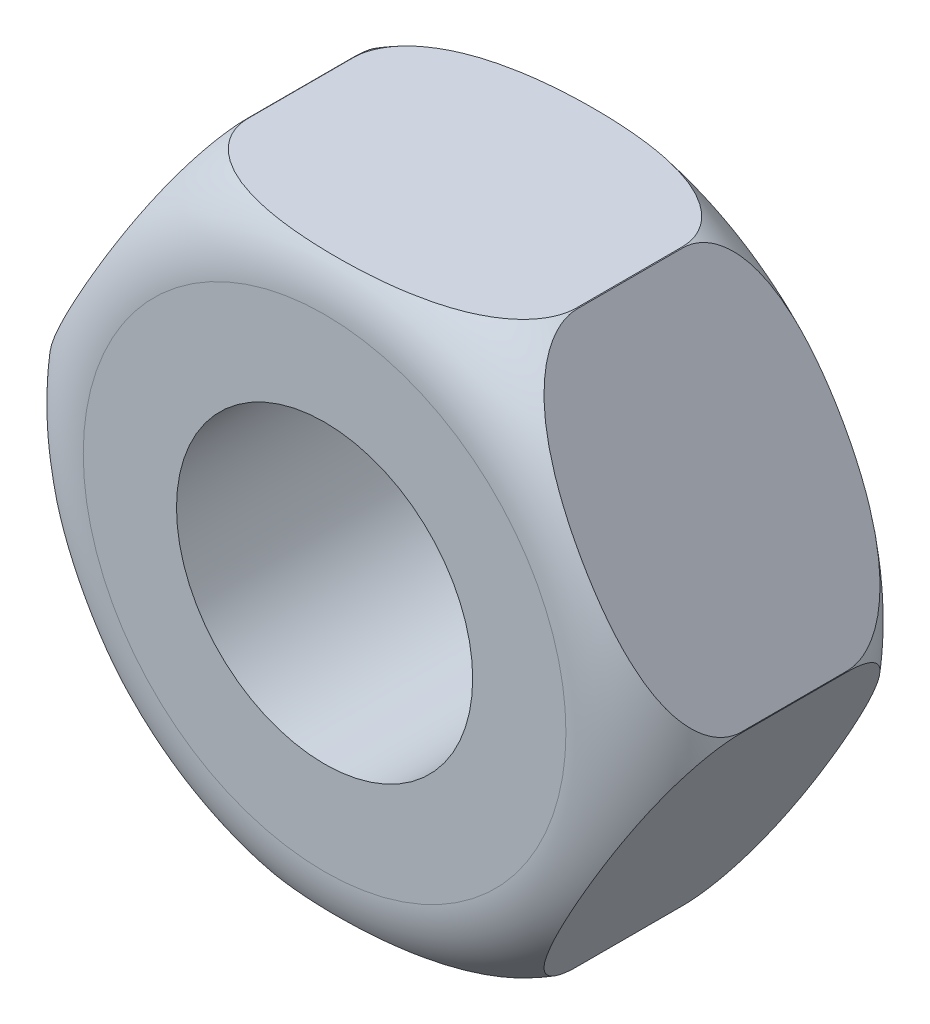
ISO-10303-21;
HEADER;
FILE_DESCRIPTION(('STEP AP214'),'2;1');
FILE_NAME('part.step','',(''),(''),'','','');
FILE_SCHEMA(('AUTOMOTIVE_DESIGN { 1 0 10303 214 1 1 1 1 }'));
ENDSEC;
DATA;
#1=APPLICATION_CONTEXT('core data for automotive mechanical design processes');
#2=APPLICATION_PROTOCOL_DEFINITION('international standard','automotive_design',2000,#1);
#3=PRODUCT_CONTEXT('',#1,'mechanical');
#4=PRODUCT('Part','Part','',(#3));
#5=PRODUCT_RELATED_PRODUCT_CATEGORY('part','',(#4));
#6=PRODUCT_DEFINITION_FORMATION('','',#4);
#7=PRODUCT_DEFINITION_CONTEXT('part definition',#1,'design');
#8=PRODUCT_DEFINITION('design','',#6,#7);
#9=PRODUCT_DEFINITION_SHAPE('','',#8);
#10=(LENGTH_UNIT() NAMED_UNIT(*) SI_UNIT(.MILLI.,.METRE.));
#11=(NAMED_UNIT(*) PLANE_ANGLE_UNIT() SI_UNIT($,.RADIAN.));
#12=(NAMED_UNIT(*) SI_UNIT($,.STERADIAN.) SOLID_ANGLE_UNIT());
#13=UNCERTAINTY_MEASURE_WITH_UNIT(LENGTH_MEASURE(1.E-05),#10,'distance_accuracy_value','');
#14=(GEOMETRIC_REPRESENTATION_CONTEXT(3) GLOBAL_UNCERTAINTY_ASSIGNED_CONTEXT((#13)) GLOBAL_UNIT_ASSIGNED_CONTEXT((#10,
#11,#12)) REPRESENTATION_CONTEXT('',''));
#15=CARTESIAN_POINT('',(0.,0.,0.));
#16=DIRECTION('',(0.,0.,1.));
#17=DIRECTION('',(1.,0.,0.));
#18=AXIS2_PLACEMENT_3D('',#15,#16,#17);
#19=CARTESIAN_POINT('',(0.,0.,6.4));
#20=DIRECTION('',(0.,0.,-1.));
#21=DIRECTION('',(-1.,0.,0.));
#22=AXIS2_PLACEMENT_3D('',#19,#20,#21);
#23=CYLINDRICAL_SURFACE('',#22,7.5);
#24=DIRECTION('',(0.,0.,-1.));
#25=VECTOR('',#24,1.);
#26=CARTESIAN_POINT('',(3.75833643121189,-6.49037034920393,6.4));
#27=LINE('',#26,#25);
#28=CARTESIAN_POINT('',(3.75833643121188,-6.49037034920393,4.4));
#29=VERTEX_POINT('',#28);
#30=CARTESIAN_POINT('',(3.75833643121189,-6.49037034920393,2.));
#31=VERTEX_POINT('',#30);
#32=EDGE_CURVE('E144',#29,#31,#27,.T.);
#33=ORIENTED_EDGE('',*,*,#32,.F.);
#34=CARTESIAN_POINT('',(0.,0.,4.4));
#35=DIRECTION('',(0.,0.,1.));
#36=DIRECTION('',(1.,0.,0.));
#37=AXIS2_PLACEMENT_3D('',#34,#35,#36);
#38=CIRCLE('',#37,7.5);
#39=CARTESIAN_POINT('',(3.74165738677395,-6.5,4.4));
#40=VERTEX_POINT('',#39);
#41=EDGE_CURVE('E141',#29,#40,#38,.F.);
#42=ORIENTED_EDGE('',*,*,#41,.T.);
#43=DIRECTION('',(0.,0.,-1.));
#44=VECTOR('',#43,1.);
#45=CARTESIAN_POINT('',(3.74165738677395,-6.5,6.4));
#46=LINE('',#45,#44);
#47=CARTESIAN_POINT('',(3.74165738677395,-6.5,2.));
#48=VERTEX_POINT('',#47);
#49=EDGE_CURVE('E278',#48,#40,#46,.F.);
#50=ORIENTED_EDGE('',*,*,#49,.F.);
#51=CARTESIAN_POINT('',(0.,0.,2.));
#52=DIRECTION('',(0.,0.,1.));
#53=DIRECTION('',(1.,0.,0.));
#54=AXIS2_PLACEMENT_3D('',#51,#52,#53);
#55=CIRCLE('',#54,7.5);
#56=EDGE_CURVE('E152',#48,#31,#55,.T.);
#57=ORIENTED_EDGE('',*,*,#56,.T.);
#58=EDGE_LOOP('',(#33,#42,#50,#57));
#59=FACE_BOUND('',#58,.T.);
#60=ADVANCED_FACE('F24',(#59),#23,.T.);
#61=DIRECTION('',(0.,0.,-1.));
#62=VECTOR('',#61,1.);
#63=CARTESIAN_POINT('',(7.49999381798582,-0.00962965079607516,6.4));
#64=LINE('',#63,#62);
#65=CARTESIAN_POINT('',(7.49999381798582,-0.00962965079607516,2.));
#66=VERTEX_POINT('',#65);
#67=CARTESIAN_POINT('',(7.49999381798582,-0.00962965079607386,4.4));
#68=VERTEX_POINT('',#67);
#69=EDGE_CURVE('E250',#66,#68,#64,.F.);
#70=ORIENTED_EDGE('',*,*,#69,.F.);
#71=CARTESIAN_POINT('',(7.49999381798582,0.00962965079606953,2.));
#72=VERTEX_POINT('',#71);
#73=EDGE_CURVE('E133',#66,#72,#55,.T.);
#74=ORIENTED_EDGE('',*,*,#73,.T.);
#75=DIRECTION('',(0.,0.,-1.));
#76=VECTOR('',#75,1.);
#77=CARTESIAN_POINT('',(7.49999381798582,0.00962965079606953,6.4));
#78=LINE('',#77,#76);
#79=CARTESIAN_POINT('',(7.49999381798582,0.00962965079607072,4.4));
#80=VERTEX_POINT('',#79);
#81=EDGE_CURVE('E117',#80,#72,#78,.T.);
#82=ORIENTED_EDGE('',*,*,#81,.F.);
#83=EDGE_CURVE('E131',#80,#68,#38,.F.);
#84=ORIENTED_EDGE('',*,*,#83,.T.);
#85=EDGE_LOOP('',(#70,#74,#82,#84));
#86=FACE_BOUND('',#85,.T.);
#87=ADVANCED_FACE('F130',(#86),#23,.T.);
#88=DIRECTION('',(0.,0.,-1.));
#89=VECTOR('',#88,1.);
#90=CARTESIAN_POINT('',(-3.74165738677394,-6.5,6.4));
#91=LINE('',#90,#89);
#92=CARTESIAN_POINT('',(-3.74165738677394,-6.5,4.4));
#93=VERTEX_POINT('',#92);
#94=CARTESIAN_POINT('',(-3.74165738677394,-6.5,2.));
#95=VERTEX_POINT('',#94);
#96=EDGE_CURVE('E251',#93,#95,#91,.T.);
#97=ORIENTED_EDGE('',*,*,#96,.F.);
#98=CARTESIAN_POINT('',(-3.75833643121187,-6.49037034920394,4.4));
#99=VERTEX_POINT('',#98);
#100=EDGE_CURVE('E148',#93,#99,#38,.F.);
#101=ORIENTED_EDGE('',*,*,#100,.T.);
#102=DIRECTION('',(0.,0.,-1.));
#103=VECTOR('',#102,1.);
#104=CARTESIAN_POINT('',(-3.75833643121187,-6.49037034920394,6.4));
#105=LINE('',#104,#103);
#106=CARTESIAN_POINT('',(-3.75833643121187,-6.49037034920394,2.));
#107=VERTEX_POINT('',#106);
#108=EDGE_CURVE('E273',#107,#99,#105,.F.);
#109=ORIENTED_EDGE('',*,*,#108,.F.);
#110=EDGE_CURVE('E284',#107,#95,#55,.T.);
#111=ORIENTED_EDGE('',*,*,#110,.T.);
#112=EDGE_LOOP('',(#97,#101,#109,#111));
#113=FACE_BOUND('',#112,.T.);
#114=ADVANCED_FACE('F304',(#113),#23,.T.);
#115=DIRECTION('',(0.,0.,-1.));
#116=VECTOR('',#115,1.);
#117=CARTESIAN_POINT('',(-7.49999381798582,-0.00962965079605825,6.4));
#118=LINE('',#117,#116);
#119=CARTESIAN_POINT('',(-7.49999381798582,-0.00962965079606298,4.4));
#120=VERTEX_POINT('',#119);
#121=CARTESIAN_POINT('',(-7.49999381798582,-0.00962965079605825,2.));
#122=VERTEX_POINT('',#121);
#123=EDGE_CURVE('E271',#120,#122,#118,.T.);
#124=ORIENTED_EDGE('',*,*,#123,.F.);
#125=CARTESIAN_POINT('',(-7.49999381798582,0.00962965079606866,4.4));
#126=VERTEX_POINT('',#125);
#127=EDGE_CURVE('E155',#120,#126,#38,.F.);
#128=ORIENTED_EDGE('',*,*,#127,.T.);
#129=DIRECTION('',(0.,0.,-1.));
#130=VECTOR('',#129,1.);
#131=CARTESIAN_POINT('',(-7.49999381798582,0.00962965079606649,6.4));
#132=LINE('',#131,#130);
#133=CARTESIAN_POINT('',(-7.49999381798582,0.00962965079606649,2.));
#134=VERTEX_POINT('',#133);
#135=EDGE_CURVE('E209',#134,#126,#132,.F.);
#136=ORIENTED_EDGE('',*,*,#135,.F.);
#137=EDGE_CURVE('E277',#134,#122,#55,.T.);
#138=ORIENTED_EDGE('',*,*,#137,.T.);
#139=EDGE_LOOP('',(#124,#128,#136,#138));
#140=FACE_BOUND('',#139,.T.);
#141=ADVANCED_FACE('F275',(#140),#23,.T.);
#142=DIRECTION('',(0.,0.,-1.));
#143=VECTOR('',#142,1.);
#144=CARTESIAN_POINT('',(-3.75833643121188,6.49037034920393,6.4));
#145=LINE('',#144,#143);
#146=CARTESIAN_POINT('',(-3.75833643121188,6.49037034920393,4.4));
#147=VERTEX_POINT('',#146);
#148=CARTESIAN_POINT('',(-3.75833643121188,6.49037034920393,2.));
#149=VERTEX_POINT('',#148);
#150=EDGE_CURVE('E172',#147,#149,#145,.T.);
#151=ORIENTED_EDGE('',*,*,#150,.F.);
#152=CARTESIAN_POINT('',(-3.74165738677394,6.5,4.4));
#153=VERTEX_POINT('',#152);
#154=EDGE_CURVE('E142',#147,#153,#38,.F.);
#155=ORIENTED_EDGE('',*,*,#154,.T.);
#156=DIRECTION('',(0.,0.,-1.));
#157=VECTOR('',#156,1.);
#158=CARTESIAN_POINT('',(-3.74165738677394,6.5,6.4));
#159=LINE('',#158,#157);
#160=CARTESIAN_POINT('',(-3.74165738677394,6.5,2.));
#161=VERTEX_POINT('',#160);
#162=EDGE_CURVE('E51',#161,#153,#159,.F.);
#163=ORIENTED_EDGE('',*,*,#162,.F.);
#164=EDGE_CURVE('E283',#161,#149,#55,.T.);
#165=ORIENTED_EDGE('',*,*,#164,.T.);
#166=EDGE_LOOP('',(#151,#155,#163,#165));
#167=FACE_BOUND('',#166,.T.);
#168=ADVANCED_FACE('F169',(#167),#23,.T.);
#169=DIRECTION('',(0.,0.,-1.));
#170=VECTOR('',#169,1.);
#171=CARTESIAN_POINT('',(3.74165738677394,6.5,6.4));
#172=LINE('',#171,#170);
#173=CARTESIAN_POINT('',(3.74165738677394,6.5,4.4));
#174=VERTEX_POINT('',#173);
#175=CARTESIAN_POINT('',(3.74165738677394,6.5,2.));
#176=VERTEX_POINT('',#175);
#177=EDGE_CURVE('E210',#174,#176,#172,.T.);
#178=ORIENTED_EDGE('',*,*,#177,.F.);
#179=CARTESIAN_POINT('',(3.75833643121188,6.49037034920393,4.4));
#180=VERTEX_POINT('',#179);
#181=EDGE_CURVE('E138',#174,#180,#38,.F.);
#182=ORIENTED_EDGE('',*,*,#181,.T.);
#183=DIRECTION('',(0.,0.,-1.));
#184=VECTOR('',#183,1.);
#185=CARTESIAN_POINT('',(3.75833643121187,6.49037034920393,6.4));
#186=LINE('',#185,#184);
#187=CARTESIAN_POINT('',(3.75833643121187,6.49037034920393,2.));
#188=VERTEX_POINT('',#187);
#189=EDGE_CURVE('E43',#188,#180,#186,.F.);
#190=ORIENTED_EDGE('',*,*,#189,.F.);
#191=EDGE_CURVE('E153',#188,#176,#55,.T.);
#192=ORIENTED_EDGE('',*,*,#191,.T.);
#193=EDGE_LOOP('',(#178,#182,#190,#192));
#194=FACE_BOUND('',#193,.T.);
#195=ADVANCED_FACE('F217',(#194),#23,.T.);
#196=CARTESIAN_POINT('',(0.,0.,2.));
#197=DIRECTION('',(0.,0.,1.));
#198=DIRECTION('',(1.,0.,0.));
#199=AXIS2_PLACEMENT_3D('',#196,#197,#198);
#200=TOROIDAL_SURFACE('',#199,5.5,2.);
#201=CARTESIAN_POINT('',(0.,0.,0.));
#202=DIRECTION('',(0.,0.,1.));
#203=DIRECTION('',(1.,0.,0.));
#204=AXIS2_PLACEMENT_3D('',#201,#202,#203);
#205=CIRCLE('',#204,5.5);
#206=CARTESIAN_POINT('',(5.5,0.,0.));
#207=VERTEX_POINT('',#206);
#208=EDGE_CURVE('E287',#207,#207,#205,.F.);
#209=ORIENTED_EDGE('',*,*,#208,.F.);
#210=EDGE_LOOP('',(#209));
#211=FACE_BOUND('',#210,.T.);
#212=ORIENTED_EDGE('',*,*,#73,.F.);
#213=CARTESIAN_POINT('',(7.49999380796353,-0.00962966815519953,2.0002));
#214=CARTESIAN_POINT('',(7.49999925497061,-0.0096202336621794,1.97066243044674));
#215=CARTESIAN_POINT('',(7.49934337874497,-0.0107562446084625,1.94114046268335));
#216=CARTESIAN_POINT('',(7.49673746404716,-0.015269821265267,1.88234493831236));
#217=CARTESIAN_POINT('',(7.49478827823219,-0.0186459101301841,1.8530712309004));
#218=CARTESIAN_POINT('',(7.48708508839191,-0.0319882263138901,1.76637316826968));
#219=CARTESIAN_POINT('',(7.47947443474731,-0.0451702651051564,1.70957396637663));
#220=CARTESIAN_POINT('',(7.45985450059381,-0.0791529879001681,1.59933148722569));
#221=CARTESIAN_POINT('',(7.4478554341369,-0.0999359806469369,1.54588075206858));
#222=CARTESIAN_POINT('',(7.42014703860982,-0.147928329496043,1.44289692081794));
#223=CARTESIAN_POINT('',(7.40443030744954,-0.175150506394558,1.39337190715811));
#224=CARTESIAN_POINT('',(7.36038300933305,-0.251442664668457,1.27223460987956));
#225=CARTESIAN_POINT('',(7.32991090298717,-0.30422190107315,1.2037405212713));
#226=CARTESIAN_POINT('',(7.26396516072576,-0.418443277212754,1.07718811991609));
#227=CARTESIAN_POINT('',(7.22847964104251,-0.479906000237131,1.01915537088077));
#228=CARTESIAN_POINT('',(7.16102561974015,-0.596739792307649,0.922412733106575));
#229=CARTESIAN_POINT('',(7.12961528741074,-0.651144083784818,0.882113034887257));
#230=CARTESIAN_POINT('',(7.06515069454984,-0.76280003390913,0.807111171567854));
#231=CARTESIAN_POINT('',(7.03209531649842,-0.820053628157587,0.772412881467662));
#232=CARTESIAN_POINT('',(6.96476461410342,-0.936673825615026,0.707945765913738));
#233=CARTESIAN_POINT('',(6.93048777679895,-0.996043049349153,0.678183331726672));
#234=CARTESIAN_POINT('',(6.86108223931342,-1.11625696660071,0.623041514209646));
#235=CARTESIAN_POINT('',(6.82595375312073,-1.17710128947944,0.597661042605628));
#236=CARTESIAN_POINT('',(6.74568820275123,-1.31612530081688,0.544522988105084));
#237=CARTESIAN_POINT('',(6.70036208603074,-1.39463243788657,0.517913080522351));
#238=CARTESIAN_POINT('',(6.60901973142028,-1.55284203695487,0.4698814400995));
#239=CARTESIAN_POINT('',(6.5630032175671,-1.63254497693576,0.44846184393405));
#240=CARTESIAN_POINT('',(6.47044528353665,-1.79286002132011,0.410021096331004));
#241=CARTESIAN_POINT('',(6.4239031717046,-1.87347332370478,0.393006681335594));
#242=CARTESIAN_POINT('',(6.33050743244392,-2.03523948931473,0.362790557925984));
#243=CARTESIAN_POINT('',(6.28365375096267,-2.11639244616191,0.349589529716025));
#244=CARTESIAN_POINT('',(6.14204293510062,-2.36166957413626,0.31473444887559));
#245=CARTESIAN_POINT('',(6.04697421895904,-2.52633342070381,0.298116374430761));
#246=CARTESIAN_POINT('',(5.85663702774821,-2.85600710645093,0.27547060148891));
#247=CARTESIAN_POINT('',(5.76136882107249,-3.02101648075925,0.269433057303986));
#248=CARTESIAN_POINT('',(5.6152388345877,-3.27412104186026,0.267528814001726));
#249=CARTESIAN_POINT('',(5.56438306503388,-3.36220581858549,0.268232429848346));
#250=CARTESIAN_POINT('',(5.46270096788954,-3.53832437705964,0.272427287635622));
#251=CARTESIAN_POINT('',(5.41187463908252,-3.6263581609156,0.275918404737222));
#252=CARTESIAN_POINT('',(5.31023125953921,-3.80240965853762,0.285854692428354));
#253=CARTESIAN_POINT('',(5.2594142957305,-3.8904272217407,0.292303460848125));
#254=CARTESIAN_POINT('',(5.15791312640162,-4.06623240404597,0.308459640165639));
#255=CARTESIAN_POINT('',(5.10722890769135,-4.15402004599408,0.31816671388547));
#256=CARTESIAN_POINT('',(5.00657163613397,-4.32836355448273,0.341169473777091));
#257=CARTESIAN_POINT('',(4.95659652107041,-4.41492299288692,0.354428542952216));
#258=CARTESIAN_POINT('',(4.85697551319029,-4.5874716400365,0.385153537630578));
#259=CARTESIAN_POINT('',(4.80732955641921,-4.67346095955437,0.40261861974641));
#260=CARTESIAN_POINT('',(4.70862334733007,-4.84442512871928,0.442459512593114));
#261=CARTESIAN_POINT('',(4.65956217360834,-4.92940157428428,0.46482608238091));
#262=CARTESIAN_POINT('',(4.56220723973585,-5.09802526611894,0.515395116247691));
#263=CARTESIAN_POINT('',(4.51391309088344,-5.18167318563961,0.543594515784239));
#264=CARTESIAN_POINT('',(4.44136415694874,-5.30733162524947,0.591758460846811));
#265=CARTESIAN_POINT('',(4.41668715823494,-5.35007344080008,0.60918728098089));
#266=CARTESIAN_POINT('',(4.36772334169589,-5.4348812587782,0.646115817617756));
#267=CARTESIAN_POINT('',(4.34343654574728,-5.47694722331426,0.665615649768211));
#268=CARTESIAN_POINT('',(4.27122014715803,-5.60202969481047,0.727583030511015));
#269=CARTESIAN_POINT('',(4.22399951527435,-5.68381822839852,0.773476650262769));
#270=CARTESIAN_POINT('',(4.13217168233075,-5.84286870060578,0.876565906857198));
#271=CARTESIAN_POINT('',(4.08759008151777,-5.92008629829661,0.933854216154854));
#272=CARTESIAN_POINT('',(4.00329482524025,-6.06608996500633,1.06139908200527));
#273=CARTESIAN_POINT('',(3.96357060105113,-6.13489433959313,1.13162661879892));
#274=CARTESIAN_POINT('',(3.90412968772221,-6.23784902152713,1.25967464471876));
#275=CARTESIAN_POINT('',(3.88223501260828,-6.27577171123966,1.31343410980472));
#276=CARTESIAN_POINT('',(3.84278465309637,-6.34410173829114,1.42704121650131));
#277=CARTESIAN_POINT('',(3.82522491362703,-6.37451609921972,1.48688309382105));
#278=CARTESIAN_POINT('',(3.79773084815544,-6.42213721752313,1.60298696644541));
#279=CARTESIAN_POINT('',(3.78706892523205,-6.44060420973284,1.65855640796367));
#280=CARTESIAN_POINT('',(3.77053986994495,-6.46923337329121,1.77244609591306));
#281=CARTESIAN_POINT('',(3.76466246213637,-6.47941334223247,1.83076016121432));
#282=CARTESIAN_POINT('',(3.76037533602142,-6.48683886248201,1.90794943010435));
#283=CARTESIAN_POINT('',(3.75960962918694,-6.48816510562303,1.92637273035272));
#284=CARTESIAN_POINT('',(3.75858972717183,-6.48993162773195,1.96326150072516));
#285=CARTESIAN_POINT('',(3.75833513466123,-6.49037259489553,1.98172692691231));
#286=CARTESIAN_POINT('',(3.75833644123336,-6.49037033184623,2.00019999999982));
#287=B_SPLINE_CURVE_WITH_KNOTS('',3,(#213,#214,#215,#216,#217,#218,#219,#220,#221,#222,#223,
#224,#225,#226,#227,#228,#229,#230,#231,#232,#233,#234,#235,#236,#237,#238,#239,#240,#241,#242,
#243,#244,#245,#246,#247,#248,#249,#250,#251,#252,#253,#254,#255,#256,#257,#258,#259,#260,#261,
#262,#263,#264,#265,#266,#267,#268,#269,#270,#271,#272,#273,#274,#275,#276,#277,#278,#279,#280,
#281,#282,#283,#284,#285,#286),.UNSPECIFIED.,.F.,.F.,(4,2,2,2,2,2,2,2,2,2,2,2,2,2,2,2,2,2,2,2,2,
2,2,2,2,2,2,2,2,2,2,2,2,2,2,2,4),(0.,0.0885532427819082,0.177048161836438,0.352564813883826,
0.527675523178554,0.70313786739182,0.976627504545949,1.25077664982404,1.47437038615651,
1.69811814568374,1.92215340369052,2.14613294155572,2.42937122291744,2.71272590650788,
2.99651137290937,3.28034742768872,3.85252090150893,4.42416165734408,4.72927181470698,
5.03436830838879,5.33983692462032,5.64527393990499,5.947675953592,6.25001738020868,
6.55179362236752,6.8534117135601,7.01039230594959,7.16738166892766,7.48176855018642,
7.79882536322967,8.11517955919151,8.32254419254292,8.52971410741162,8.70755493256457,
8.88501280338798,8.94045265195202,8.99584938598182),.UNSPECIFIED.);
#288=EDGE_CURVE('E139',#66,#31,#287,.T.);
#289=ORIENTED_EDGE('',*,*,#288,.T.);
#290=ORIENTED_EDGE('',*,*,#56,.F.);
#291=CARTESIAN_POINT('',(0.,-6.5,0.267949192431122));
#292=CARTESIAN_POINT('',(-0.178382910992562,-6.5,0.267942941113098));
#293=CARTESIAN_POINT('',(-0.356774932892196,-6.5,0.272135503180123));
#294=CARTESIAN_POINT('',(-0.713249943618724,-6.5,0.289519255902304));
#295=CARTESIAN_POINT('',(-0.891332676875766,-6.5,0.302715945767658));
#296=CARTESIAN_POINT('',(-1.24661200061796,-6.5,0.340053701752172));
#297=CARTESIAN_POINT('',(-1.42380719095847,-6.5,0.364208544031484));
#298=CARTESIAN_POINT('',(-1.77561919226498,-6.5,0.426764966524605));
#299=CARTESIAN_POINT('',(-1.95023899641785,-6.5,0.465148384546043));
#300=CARTESIAN_POINT('',(-2.20895335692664,-6.5,0.537409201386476));
#301=CARTESIAN_POINT('',(-2.2950518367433,-6.5,0.564104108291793));
#302=CARTESIAN_POINT('',(-2.46522288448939,-6.5,0.623269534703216));
#303=CARTESIAN_POINT('',(-2.54929648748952,-6.5,0.655737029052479));
#304=CARTESIAN_POINT('',(-2.71409640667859,-6.5,0.727242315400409));
#305=CARTESIAN_POINT('',(-2.79483842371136,-6.5,0.766243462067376));
#306=CARTESIAN_POINT('',(-2.95203819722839,-6.5,0.852005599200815));
#307=CARTESIAN_POINT('',(-3.02850124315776,-6.5,0.898756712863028));
#308=CARTESIAN_POINT('',(-3.16601858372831,-6.5,0.994771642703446));
#309=CARTESIAN_POINT('',(-3.22780143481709,-6.5,1.04298028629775));
#310=CARTESIAN_POINT('',(-3.34480655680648,-6.5,1.14702027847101));
#311=CARTESIAN_POINT('',(-3.40002238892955,-6.5,1.20285899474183));
#312=CARTESIAN_POINT('',(-3.50181296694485,-6.5,1.32320639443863));
#313=CARTESIAN_POINT('',(-3.54827794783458,-6.5,1.38780969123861));
#314=CARTESIAN_POINT('',(-3.62820687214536,-6.5,1.52460965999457));
#315=CARTESIAN_POINT('',(-3.66170470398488,-6.5,1.59678590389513));
#316=CARTESIAN_POINT('',(-3.7053492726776,-6.5,1.72616171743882));
#317=CARTESIAN_POINT('',(-3.71937706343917,-6.5,1.78205727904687));
#318=CARTESIAN_POINT('',(-3.73779781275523,-6.5,1.89542079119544));
#319=CARTESIAN_POINT('',(-3.74219613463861,-6.5,1.95288784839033));
#320=CARTESIAN_POINT('',(-3.74101181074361,-6.5,2.06776067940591));
#321=CARTESIAN_POINT('',(-3.73542114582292,-6.5,2.12516636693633));
#322=CARTESIAN_POINT('',(-3.71468405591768,-6.5,2.2382178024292));
#323=CARTESIAN_POINT('',(-3.69953404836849,-6.5,2.29386288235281));
#324=CARTESIAN_POINT('',(-3.66064665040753,-6.5,2.40231550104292));
#325=CARTESIAN_POINT('',(-3.63686959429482,-6.5,2.45510861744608));
#326=CARTESIAN_POINT('',(-3.58211536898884,-6.5,2.55678139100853));
#327=CARTESIAN_POINT('',(-3.55113504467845,-6.5,2.60565932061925));
#328=CARTESIAN_POINT('',(-3.46375525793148,-6.5,2.72616167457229));
#329=CARTESIAN_POINT('',(-3.40300525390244,-6.5,2.79463126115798));
#330=CARTESIAN_POINT('',(-3.27148396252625,-6.5,2.92117660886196));
#331=CARTESIAN_POINT('',(-3.20068629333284,-6.5,2.97922406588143));
#332=CARTESIAN_POINT('',(-3.06615166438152,-6.5,3.07595851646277));
#333=CARTESIAN_POINT('',(-3.00353734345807,-6.5,3.11623987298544));
#334=CARTESIAN_POINT('',(-2.87502160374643,-6.5,3.1912225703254));
#335=CARTESIAN_POINT('',(-2.80911795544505,-6.5,3.22592005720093));
#336=CARTESIAN_POINT('',(-2.67486454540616,-6.5,3.29040166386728));
#337=CARTESIAN_POINT('',(-2.60651157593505,-6.5,3.32017903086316));
#338=CARTESIAN_POINT('',(-2.46809938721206,-6.5,3.37536009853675));
#339=CARTESIAN_POINT('',(-2.39804059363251,-6.5,3.4007648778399));
#340=CARTESIAN_POINT('',(-2.23806843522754,-6.5,3.45392977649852));
#341=CARTESIAN_POINT('',(-2.14777864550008,-6.5,3.48055249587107));
#342=CARTESIAN_POINT('',(-1.9658191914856,-6.5,3.52862340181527));
#343=CARTESIAN_POINT('',(-1.87414897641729,-6.5,3.55006946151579));
#344=CARTESIAN_POINT('',(-1.59750514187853,-6.5,3.60787814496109));
#345=CARTESIAN_POINT('',(-1.4111498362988,-6.5,3.63763318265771));
#346=CARTESIAN_POINT('',(-1.03552477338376,-6.5,3.6842588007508));
#347=CARTESIAN_POINT('',(-0.846243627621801,-6.5,3.70102930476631));
#348=CARTESIAN_POINT('',(-0.46724257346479,-6.5,3.72400657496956));
#349=CARTESIAN_POINT('',(-0.277523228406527,-6.5,3.73022303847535));
#350=CARTESIAN_POINT('',(0.114586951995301,-6.5,3.73329275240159));
#351=CARTESIAN_POINT('',(0.316983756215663,-6.5,3.72949773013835));
#352=CARTESIAN_POINT('',(0.620272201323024,-6.5,3.71515045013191));
#353=CARTESIAN_POINT('',(0.721379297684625,-6.5,3.7089190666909));
#354=CARTESIAN_POINT('',(0.923341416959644,-6.5,3.69324831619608));
#355=CARTESIAN_POINT('',(1.02419646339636,-6.5,3.6838092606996));
#356=CARTESIAN_POINT('',(1.22472941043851,-6.5,3.66138865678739));
#357=CARTESIAN_POINT('',(1.32441039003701,-6.5,3.6484349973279));
#358=CARTESIAN_POINT('',(1.52313779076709,-6.5,3.61839116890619));
#359=CARTESIAN_POINT('',(1.62218432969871,-6.5,3.60130179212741));
#360=CARTESIAN_POINT('',(1.81915656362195,-6.5,3.56229833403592));
#361=CARTESIAN_POINT('',(1.91708390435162,-6.5,3.54039267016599));
#362=CARTESIAN_POINT('',(2.11146048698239,-6.5,3.49085491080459));
#363=CARTESIAN_POINT('',(2.2079104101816,-6.5,3.46322554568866));
#364=CARTESIAN_POINT('',(2.37106828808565,-6.5,3.41010532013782));
#365=CARTESIAN_POINT('',(2.43832381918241,-6.5,3.38629994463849));
#366=CARTESIAN_POINT('',(2.57134503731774,-6.5,3.33476318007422));
#367=CARTESIAN_POINT('',(2.63711039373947,-6.5,3.3070309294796));
#368=CARTESIAN_POINT('',(2.76651199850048,-6.5,3.24716895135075));
#369=CARTESIAN_POINT('',(2.83015122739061,-6.5,3.21504573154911));
#370=CARTESIAN_POINT('',(2.95463828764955,-6.5,3.14582419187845));
#371=CARTESIAN_POINT('',(3.01548763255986,-6.5,3.10872861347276));
#372=CARTESIAN_POINT('',(3.14732468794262,-6.5,3.01957832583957));
#373=CARTESIAN_POINT('',(3.21733970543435,-6.5,2.96605612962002));
#374=CARTESIAN_POINT('',(3.34902034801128,-6.5,2.84948617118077));
#375=CARTESIAN_POINT('',(3.41069506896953,-6.5,2.78644894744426));
#376=CARTESIAN_POINT('',(3.50969004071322,-6.5,2.66542485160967));
#377=CARTESIAN_POINT('',(3.54938123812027,-6.5,2.60939383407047));
#378=CARTESIAN_POINT('',(3.61918714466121,-6.5,2.49163236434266));
#379=CARTESIAN_POINT('',(3.64931483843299,-6.5,2.42990978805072));
#380=CARTESIAN_POINT('',(3.69403497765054,-6.5,2.31168656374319));
#381=CARTESIAN_POINT('',(3.71029351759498,-6.5,2.25581993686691));
#382=CARTESIAN_POINT('',(3.73316218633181,-6.5,2.14213623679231));
#383=CARTESIAN_POINT('',(3.73977717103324,-6.5,2.08432016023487));
#384=CARTESIAN_POINT('',(3.74284313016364,-6.5,1.9683248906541));
#385=CARTESIAN_POINT('',(3.73927812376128,-6.5,1.91014526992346));
#386=CARTESIAN_POINT('',(3.72223870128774,-6.5,1.79526250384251));
#387=CARTESIAN_POINT('',(3.70876123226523,-6.5,1.73855981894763));
#388=CARTESIAN_POINT('',(3.67313941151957,-6.5,1.62886299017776));
#389=CARTESIAN_POINT('',(3.6511181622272,-6.5,1.57582824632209));
#390=CARTESIAN_POINT('',(3.59971838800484,-6.5,1.47348883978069));
#391=CARTESIAN_POINT('',(3.57033676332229,-6.5,1.42418576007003));
#392=CARTESIAN_POINT('',(3.48803977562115,-6.5,1.30418078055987));
#393=CARTESIAN_POINT('',(3.43098749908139,-6.5,1.23631435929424));
#394=CARTESIAN_POINT('',(3.30688543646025,-6.5,1.11045918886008));
#395=CARTESIAN_POINT('',(3.23981115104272,-6.5,1.05249541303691));
#396=CARTESIAN_POINT('',(3.05631551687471,-6.5,0.913361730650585));
#397=CARTESIAN_POINT('',(2.93454577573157,-6.5,0.839302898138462));
#398=CARTESIAN_POINT('',(2.68154270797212,-6.5,0.709856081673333));
#399=CARTESIAN_POINT('',(2.55028431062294,-6.5,0.654519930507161));
#400=CARTESIAN_POINT('',(2.28126048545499,-6.5,0.55801827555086));
#401=CARTESIAN_POINT('',(2.14344202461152,-6.5,0.517004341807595));
#402=CARTESIAN_POINT('',(1.86480290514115,-6.5,0.446596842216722));
#403=CARTESIAN_POINT('',(1.72397900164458,-6.5,0.417216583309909));
#404=CARTESIAN_POINT('',(1.4406511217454,-6.5,0.367617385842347));
#405=CARTESIAN_POINT('',(1.29814583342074,-6.5,0.347406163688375));
#406=CARTESIAN_POINT('',(1.01237523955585,-6.5,0.314395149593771));
#407=CARTESIAN_POINT('',(0.869110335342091,-6.5,0.301591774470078));
#408=CARTESIAN_POINT('',(0.604856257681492,-6.5,0.283737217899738));
#409=CARTESIAN_POINT('',(0.483925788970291,-6.5,0.277780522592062));
#410=CARTESIAN_POINT('',(0.24199823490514,-6.5,0.26988963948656));
#411=CARTESIAN_POINT('',(0.121001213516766,-6.5,0.267953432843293));
#412=CARTESIAN_POINT('',(0.,-6.5,0.267949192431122));
#413=B_SPLINE_CURVE_WITH_KNOTS('',3,(#291,#292,#293,#294,#295,#296,#297,#298,#299,#300,#301,
#302,#303,#304,#305,#306,#307,#308,#309,#310,#311,#312,#313,#314,#315,#316,#317,#318,#319,#320,
#321,#322,#323,#324,#325,#326,#327,#328,#329,#330,#331,#332,#333,#334,#335,#336,#337,#338,#339,
#340,#341,#342,#343,#344,#345,#346,#347,#348,#349,#350,#351,#352,#353,#354,#355,#356,#357,#358,
#359,#360,#361,#362,#363,#364,#365,#366,#367,#368,#369,#370,#371,#372,#373,#374,#375,#376,#377,
#378,#379,#380,#381,#382,#383,#384,#385,#386,#387,#388,#389,#390,#391,#392,#393,#394,#395,#396,
#397,#398,#399,#400,#401,#402,#403,#404,#405,#406,#407,#408,#409,#410,#411,#412),.UNSPECIFIED.,
.T.,.F.,(4,2,2,2,2,2,2,2,2,2,2,2,2,2,2,2,2,2,2,2,2,2,2,2,2,2,2,2,2,2,2,2,2,2,2,2,2,2,2,2,2,2,2,
2,2,2,2,2,2,2,2,2,2,2,2,2,2,2,2,2,4),(0.,0.535112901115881,1.07055291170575,1.6066679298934,
2.14210096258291,2.41236560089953,2.68248902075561,2.95114522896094,3.21946164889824,
3.45403874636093,3.68884397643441,3.92642255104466,4.16337597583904,4.33551120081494,
4.50755052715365,4.67972802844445,4.85197009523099,5.0250143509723,5.19813454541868,
5.47117946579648,5.74495505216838,5.9679989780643,6.19119619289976,6.41469724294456,
6.63814308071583,6.92034768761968,7.20266804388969,7.76809514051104,8.33783796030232,
8.90705700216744,9.51402454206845,9.81788221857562,10.1217103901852,10.4231947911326,
10.7246214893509,11.0255255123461,11.326286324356,11.5402168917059,11.7541944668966,
11.9678582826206,12.1814047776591,12.4450745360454,12.7084543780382,12.9137060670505,
13.1186778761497,13.2924680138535,13.4661706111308,13.6401460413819,13.8141750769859,
13.9857845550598,14.1574664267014,14.4219322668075,14.6870555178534,15.1122081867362,
15.5385284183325,15.9692325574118,16.4004279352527,16.8319855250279,17.2633341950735,
17.6264959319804,17.9894752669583),.UNSPECIFIED.);
#414=EDGE_CURVE('E243',#48,#95,#413,.T.);
#415=ORIENTED_EDGE('',*,*,#414,.T.);
#416=ORIENTED_EDGE('',*,*,#110,.F.);
#417=CARTESIAN_POINT('',(-3.75833644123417,-6.49037033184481,2.0002));
#418=CARTESIAN_POINT('',(-3.75833099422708,-6.49037976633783,1.97066243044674));
#419=CARTESIAN_POINT('',(-3.75898687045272,-6.48924375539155,1.94114046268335));
#420=CARTESIAN_POINT('',(-3.76159278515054,-6.48473017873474,1.88234493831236));
#421=CARTESIAN_POINT('',(-3.76354197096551,-6.48135408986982,1.8530712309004));
#422=CARTESIAN_POINT('',(-3.77124516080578,-6.46801177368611,1.76637316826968));
#423=CARTESIAN_POINT('',(-3.77885581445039,-6.45482973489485,1.70957396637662));
#424=CARTESIAN_POINT('',(-3.79847574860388,-6.42084701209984,1.59933148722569));
#425=CARTESIAN_POINT('',(-3.8104748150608,-6.40006401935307,1.54588075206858));
#426=CARTESIAN_POINT('',(-3.83818321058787,-6.35207167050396,1.44289692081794));
#427=CARTESIAN_POINT('',(-3.85389994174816,-6.32484949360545,1.39337190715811));
#428=CARTESIAN_POINT('',(-3.89794723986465,-6.24855733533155,1.27223460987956));
#429=CARTESIAN_POINT('',(-3.92841934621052,-6.19577809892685,1.20374052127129));
#430=CARTESIAN_POINT('',(-3.99436508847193,-6.08155672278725,1.07718811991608));
#431=CARTESIAN_POINT('',(-4.02985060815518,-6.02009399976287,1.01915537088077));
#432=CARTESIAN_POINT('',(-4.09730462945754,-5.90326020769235,0.922412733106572));
#433=CARTESIAN_POINT('',(-4.12871496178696,-5.84885591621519,0.882113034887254));
#434=CARTESIAN_POINT('',(-4.19317955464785,-5.73719996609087,0.80711117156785));
#435=CARTESIAN_POINT('',(-4.22623493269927,-5.67994637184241,0.772412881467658));
#436=CARTESIAN_POINT('',(-4.29356563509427,-5.56332617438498,0.707945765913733));
#437=CARTESIAN_POINT('',(-4.32784247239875,-5.50395695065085,0.678183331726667));
#438=CARTESIAN_POINT('',(-4.39724800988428,-5.38374303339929,0.623041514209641));
#439=CARTESIAN_POINT('',(-4.43237649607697,-5.32289871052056,0.597661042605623));
#440=CARTESIAN_POINT('',(-4.51264204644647,-5.18387469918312,0.544522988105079));
#441=CARTESIAN_POINT('',(-4.55796816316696,-5.10536756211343,0.517913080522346));
#442=CARTESIAN_POINT('',(-4.64931051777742,-4.94715796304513,0.469881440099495));
#443=CARTESIAN_POINT('',(-4.6953270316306,-4.86745502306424,0.448461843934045));
#444=CARTESIAN_POINT('',(-4.78788496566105,-4.70713997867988,0.410021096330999));
#445=CARTESIAN_POINT('',(-4.8344270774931,-4.62652667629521,0.393006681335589));
#446=CARTESIAN_POINT('',(-4.92782281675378,-4.46476051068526,0.36279055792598));
#447=CARTESIAN_POINT('',(-4.97467649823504,-4.38360755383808,0.349589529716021));
#448=CARTESIAN_POINT('',(-5.11628731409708,-4.13833042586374,0.314734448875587));
#449=CARTESIAN_POINT('',(-5.21135603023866,-3.97366657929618,0.298116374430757));
#450=CARTESIAN_POINT('',(-5.4016932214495,-3.64399289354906,0.275470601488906));
#451=CARTESIAN_POINT('',(-5.49696142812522,-3.47898351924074,0.269433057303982));
#452=CARTESIAN_POINT('',(-5.64309141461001,-3.22587895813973,0.267528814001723));
#453=CARTESIAN_POINT('',(-5.69394718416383,-3.13779418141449,0.268232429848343));
#454=CARTESIAN_POINT('',(-5.79562928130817,-2.96167562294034,0.27242728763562));
#455=CARTESIAN_POINT('',(-5.84645561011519,-2.87364183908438,0.27591840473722));
#456=CARTESIAN_POINT('',(-5.9480989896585,-2.69759034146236,0.285854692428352));
#457=CARTESIAN_POINT('',(-5.99891595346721,-2.60957277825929,0.292303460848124));
#458=CARTESIAN_POINT('',(-6.10041712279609,-2.43376759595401,0.308459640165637));
#459=CARTESIAN_POINT('',(-6.15110134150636,-2.3459799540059,0.318166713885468));
#460=CARTESIAN_POINT('',(-6.25175861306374,-2.17163644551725,0.34116947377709));
#461=CARTESIAN_POINT('',(-6.30173372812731,-2.08507700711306,0.354428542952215));
#462=CARTESIAN_POINT('',(-6.40135473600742,-1.91252835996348,0.385153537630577));
#463=CARTESIAN_POINT('',(-6.4510006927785,-1.82653904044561,0.40261861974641));
#464=CARTESIAN_POINT('',(-6.54970690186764,-1.6555748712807,0.442459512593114));
#465=CARTESIAN_POINT('',(-6.59876807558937,-1.5705984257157,0.464826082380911));
#466=CARTESIAN_POINT('',(-6.69612300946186,-1.40197473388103,0.515395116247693));
#467=CARTESIAN_POINT('',(-6.74441715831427,-1.31832681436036,0.543594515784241));
#468=CARTESIAN_POINT('',(-6.81696609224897,-1.1926683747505,0.591758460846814));
#469=CARTESIAN_POINT('',(-6.84164309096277,-1.1499265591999,0.609187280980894));
#470=CARTESIAN_POINT('',(-6.89060690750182,-1.06511874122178,0.64611581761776));
#471=CARTESIAN_POINT('',(-6.91489370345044,-1.02305277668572,0.665615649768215));
#472=CARTESIAN_POINT('',(-6.98711010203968,-0.897970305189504,0.727583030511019));
#473=CARTESIAN_POINT('',(-7.03433073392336,-0.816181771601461,0.773476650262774));
#474=CARTESIAN_POINT('',(-7.12615856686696,-0.657131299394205,0.876565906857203));
#475=CARTESIAN_POINT('',(-7.17074016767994,-0.579913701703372,0.93385421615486));
#476=CARTESIAN_POINT('',(-7.25503542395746,-0.433910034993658,1.06139908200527));
#477=CARTESIAN_POINT('',(-7.29475964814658,-0.365105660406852,1.13162661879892));
#478=CARTESIAN_POINT('',(-7.3542005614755,-0.26215097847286,1.25967464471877));
#479=CARTESIAN_POINT('',(-7.37609523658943,-0.224228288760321,1.31343410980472));
#480=CARTESIAN_POINT('',(-7.41554559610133,-0.155898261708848,1.42704121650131));
#481=CARTESIAN_POINT('',(-7.43310533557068,-0.125483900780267,1.48688309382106));
#482=CARTESIAN_POINT('',(-7.46059940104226,-0.077862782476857,1.60298696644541));
#483=CARTESIAN_POINT('',(-7.47126132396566,-0.0593957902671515,1.65855640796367));
#484=CARTESIAN_POINT('',(-7.48779037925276,-0.0307666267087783,1.77244609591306));
#485=CARTESIAN_POINT('',(-7.49366778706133,-0.0205866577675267,1.83076016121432));
#486=CARTESIAN_POINT('',(-7.49795491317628,-0.0131611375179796,1.90794943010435));
#487=CARTESIAN_POINT('',(-7.49872062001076,-0.0118348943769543,1.92637273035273));
#488=CARTESIAN_POINT('',(-7.49974052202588,-0.0100683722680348,1.96326150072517));
#489=CARTESIAN_POINT('',(-7.49999511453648,-0.00962740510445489,1.98172692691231));
#490=CARTESIAN_POINT('',(-7.49999380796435,-0.00962966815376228,2.00019999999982));
#491=B_SPLINE_CURVE_WITH_KNOTS('',3,(#417,#418,#419,#420,#421,#422,#423,#424,#425,#426,#427,
#428,#429,#430,#431,#432,#433,#434,#435,#436,#437,#438,#439,#440,#441,#442,#443,#444,#445,#446,
#447,#448,#449,#450,#451,#452,#453,#454,#455,#456,#457,#458,#459,#460,#461,#462,#463,#464,#465,
#466,#467,#468,#469,#470,#471,#472,#473,#474,#475,#476,#477,#478,#479,#480,#481,#482,#483,#484,
#485,#486,#487,#488,#489,#490),.UNSPECIFIED.,.F.,.F.,(4,2,2,2,2,2,2,2,2,2,2,2,2,2,2,2,2,2,2,2,2,
2,2,2,2,2,2,2,2,2,2,2,2,2,2,2,4),(0.,0.0885532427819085,0.177048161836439,0.352564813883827,
0.527675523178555,0.703137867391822,0.976627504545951,1.25077664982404,1.47437038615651,
1.69811814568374,1.92215340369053,2.14613294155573,2.42937122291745,2.7127259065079,
2.99651137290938,3.28034742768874,3.85252090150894,4.4241616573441,4.729271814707,
5.03436830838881,5.33983692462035,5.64527393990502,5.94767595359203,6.25001738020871,
6.55179362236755,6.85341171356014,7.01039230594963,7.16738166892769,7.48176855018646,
7.79882536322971,8.11517955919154,8.32254419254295,8.52971410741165,8.70755493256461,
8.88501280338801,8.94045265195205,8.99584938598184),.UNSPECIFIED.);
#492=EDGE_CURVE('E236',#107,#122,#491,.T.);
#493=ORIENTED_EDGE('',*,*,#492,.T.);
#494=ORIENTED_EDGE('',*,*,#137,.F.);
#495=CARTESIAN_POINT('',(-7.49999380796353,0.00962966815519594,2.0002));
#496=CARTESIAN_POINT('',(-7.49999925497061,0.00962023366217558,1.97066243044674));
#497=CARTESIAN_POINT('',(-7.49934337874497,0.0107562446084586,1.94114046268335));
#498=CARTESIAN_POINT('',(-7.49673746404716,0.0152698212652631,1.88234493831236));
#499=CARTESIAN_POINT('',(-7.49478827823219,0.0186459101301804,1.8530712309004));
#500=CARTESIAN_POINT('',(-7.48708508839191,0.0319882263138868,1.76637316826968));
#501=CARTESIAN_POINT('',(-7.47947443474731,0.0451702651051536,1.70957396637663));
#502=CARTESIAN_POINT('',(-7.45985450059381,0.0791529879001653,1.59933148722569));
#503=CARTESIAN_POINT('',(-7.4478554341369,0.0999359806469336,1.54588075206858));
#504=CARTESIAN_POINT('',(-7.42014703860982,0.147928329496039,1.44289692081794));
#505=CARTESIAN_POINT('',(-7.40443030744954,0.175150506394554,1.39337190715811));
#506=CARTESIAN_POINT('',(-7.36038300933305,0.251442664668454,1.27223460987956));
#507=CARTESIAN_POINT('',(-7.32991090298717,0.304221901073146,1.20374052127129));
#508=CARTESIAN_POINT('',(-7.26396516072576,0.41844327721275,1.07718811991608));
#509=CARTESIAN_POINT('',(-7.22847964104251,0.479906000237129,1.01915537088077));
#510=CARTESIAN_POINT('',(-7.16102561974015,0.596739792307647,0.922412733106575));
#511=CARTESIAN_POINT('',(-7.12961528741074,0.651144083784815,0.882113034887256));
#512=CARTESIAN_POINT('',(-7.06515069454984,0.762800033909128,0.807111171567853));
#513=CARTESIAN_POINT('',(-7.03209531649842,0.820053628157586,0.772412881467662));
#514=CARTESIAN_POINT('',(-6.96476461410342,0.936673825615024,0.707945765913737));
#515=CARTESIAN_POINT('',(-6.93048777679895,0.996043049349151,0.67818333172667));
#516=CARTESIAN_POINT('',(-6.86108223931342,1.11625696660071,0.623041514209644));
#517=CARTESIAN_POINT('',(-6.82595375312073,1.17710128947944,0.597661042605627));
#518=CARTESIAN_POINT('',(-6.74568820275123,1.31612530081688,0.544522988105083));
#519=CARTESIAN_POINT('',(-6.70036208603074,1.39463243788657,0.51791308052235));
#520=CARTESIAN_POINT('',(-6.60901973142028,1.55284203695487,0.469881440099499));
#521=CARTESIAN_POINT('',(-6.5630032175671,1.63254497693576,0.448461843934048));
#522=CARTESIAN_POINT('',(-6.47044528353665,1.79286002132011,0.410021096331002));
#523=CARTESIAN_POINT('',(-6.4239031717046,1.87347332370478,0.393006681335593));
#524=CARTESIAN_POINT('',(-6.33050743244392,2.03523948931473,0.362790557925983));
#525=CARTESIAN_POINT('',(-6.28365375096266,2.11639244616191,0.349589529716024));
#526=CARTESIAN_POINT('',(-6.14204293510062,2.36166957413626,0.314734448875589));
#527=CARTESIAN_POINT('',(-6.04697421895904,2.52633342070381,0.29811637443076));
#528=CARTESIAN_POINT('',(-5.85663702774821,2.85600710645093,0.275470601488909));
#529=CARTESIAN_POINT('',(-5.76136882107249,3.02101648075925,0.269433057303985));
#530=CARTESIAN_POINT('',(-5.6152388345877,3.27412104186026,0.267528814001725));
#531=CARTESIAN_POINT('',(-5.56438306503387,3.36220581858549,0.268232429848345));
#532=CARTESIAN_POINT('',(-5.46270096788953,3.53832437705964,0.272427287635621));
#533=CARTESIAN_POINT('',(-5.41187463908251,3.6263581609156,0.27591840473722));
#534=CARTESIAN_POINT('',(-5.31023125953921,3.80240965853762,0.285854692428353));
#535=CARTESIAN_POINT('',(-5.25941429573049,3.8904272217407,0.292303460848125));
#536=CARTESIAN_POINT('',(-5.15791312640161,4.06623240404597,0.308459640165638));
#537=CARTESIAN_POINT('',(-5.10722890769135,4.15402004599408,0.318166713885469));
#538=CARTESIAN_POINT('',(-5.00657163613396,4.32836355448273,0.34116947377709));
#539=CARTESIAN_POINT('',(-4.9565965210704,4.41492299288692,0.354428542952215));
#540=CARTESIAN_POINT('',(-4.85697551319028,4.5874716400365,0.385153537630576));
#541=CARTESIAN_POINT('',(-4.80732955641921,4.67346095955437,0.402618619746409));
#542=CARTESIAN_POINT('',(-4.70862334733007,4.84442512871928,0.442459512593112));
#543=CARTESIAN_POINT('',(-4.65956217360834,4.92940157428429,0.464826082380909));
#544=CARTESIAN_POINT('',(-4.56220723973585,5.09802526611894,0.515395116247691));
#545=CARTESIAN_POINT('',(-4.51391309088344,5.18167318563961,0.543594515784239));
#546=CARTESIAN_POINT('',(-4.44136415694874,5.30733162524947,0.59175846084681));
#547=CARTESIAN_POINT('',(-4.41668715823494,5.35007344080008,0.609187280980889));
#548=CARTESIAN_POINT('',(-4.36772334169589,5.4348812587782,0.646115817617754));
#549=CARTESIAN_POINT('',(-4.34343654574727,5.47694722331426,0.66561564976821));
#550=CARTESIAN_POINT('',(-4.27122014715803,5.60202969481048,0.727583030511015));
#551=CARTESIAN_POINT('',(-4.22399951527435,5.68381822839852,0.773476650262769));
#552=CARTESIAN_POINT('',(-4.13217168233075,5.84286870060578,0.876565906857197));
#553=CARTESIAN_POINT('',(-4.08759008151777,5.92008629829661,0.933854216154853));
#554=CARTESIAN_POINT('',(-4.00329482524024,6.06608996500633,1.06139908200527));
#555=CARTESIAN_POINT('',(-3.96357060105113,6.13489433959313,1.13162661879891));
#556=CARTESIAN_POINT('',(-3.9041296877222,6.23784902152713,1.25967464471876));
#557=CARTESIAN_POINT('',(-3.88223501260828,6.27577171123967,1.31343410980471));
#558=CARTESIAN_POINT('',(-3.84278465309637,6.34410173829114,1.4270412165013));
#559=CARTESIAN_POINT('',(-3.82522491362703,6.37451609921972,1.48688309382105));
#560=CARTESIAN_POINT('',(-3.79773084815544,6.42213721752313,1.6029869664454));
#561=CARTESIAN_POINT('',(-3.78706892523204,6.44060420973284,1.65855640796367));
#562=CARTESIAN_POINT('',(-3.77053986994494,6.46923337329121,1.77244609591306));
#563=CARTESIAN_POINT('',(-3.76466246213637,6.47941334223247,1.83076016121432));
#564=CARTESIAN_POINT('',(-3.76037533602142,6.48683886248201,1.90794943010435));
#565=CARTESIAN_POINT('',(-3.75960962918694,6.48816510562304,1.92637273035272));
#566=CARTESIAN_POINT('',(-3.75858972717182,6.48993162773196,1.96326150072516));
#567=CARTESIAN_POINT('',(-3.75833513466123,6.49037259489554,1.98172692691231));
#568=CARTESIAN_POINT('',(-3.75833644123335,6.49037033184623,2.00019999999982));
#569=B_SPLINE_CURVE_WITH_KNOTS('',3,(#495,#496,#497,#498,#499,#500,#501,#502,#503,#504,#505,
#506,#507,#508,#509,#510,#511,#512,#513,#514,#515,#516,#517,#518,#519,#520,#521,#522,#523,#524,
#525,#526,#527,#528,#529,#530,#531,#532,#533,#534,#535,#536,#537,#538,#539,#540,#541,#542,#543,
#544,#545,#546,#547,#548,#549,#550,#551,#552,#553,#554,#555,#556,#557,#558,#559,#560,#561,#562,
#563,#564,#565,#566,#567,#568),.UNSPECIFIED.,.F.,.F.,(4,2,2,2,2,2,2,2,2,2,2,2,2,2,2,2,2,2,2,2,2,
2,2,2,2,2,2,2,2,2,2,2,2,2,2,2,4),(0.,0.0885532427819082,0.177048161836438,0.352564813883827,
0.527675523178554,0.703137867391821,0.97662750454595,1.25077664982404,1.47437038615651,
1.69811814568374,1.92215340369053,2.14613294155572,2.42937122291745,2.71272590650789,
2.99651137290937,3.28034742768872,3.85252090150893,4.42416165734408,4.72927181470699,
5.03436830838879,5.33983692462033,5.645273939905,5.94767595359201,6.25001738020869,
6.55179362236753,6.85341171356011,7.0103923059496,7.16738166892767,7.48176855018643,
7.79882536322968,8.11517955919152,8.32254419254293,8.52971410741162,8.70755493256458,
8.88501280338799,8.94045265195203,8.99584938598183),.UNSPECIFIED.);
#570=EDGE_CURVE('E230',#134,#149,#569,.T.);
#571=ORIENTED_EDGE('',*,*,#570,.T.);
#572=ORIENTED_EDGE('',*,*,#164,.F.);
#573=CARTESIAN_POINT('',(0.,6.5,0.267949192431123));
#574=CARTESIAN_POINT('',(0.178382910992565,6.5,0.267942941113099));
#575=CARTESIAN_POINT('',(0.356774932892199,6.5,0.272135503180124));
#576=CARTESIAN_POINT('',(0.713249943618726,6.5,0.289519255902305));
#577=CARTESIAN_POINT('',(0.891332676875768,6.5,0.30271594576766));
#578=CARTESIAN_POINT('',(1.24661200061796,6.5,0.340053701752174));
#579=CARTESIAN_POINT('',(1.42380719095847,6.5,0.364208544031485));
#580=CARTESIAN_POINT('',(1.77561919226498,6.5,0.426764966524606));
#581=CARTESIAN_POINT('',(1.95023899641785,6.5,0.465148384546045));
#582=CARTESIAN_POINT('',(2.20895335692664,6.5,0.537409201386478));
#583=CARTESIAN_POINT('',(2.2950518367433,6.5,0.564104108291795));
#584=CARTESIAN_POINT('',(2.46522288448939,6.5,0.623269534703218));
#585=CARTESIAN_POINT('',(2.54929648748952,6.5,0.65573702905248));
#586=CARTESIAN_POINT('',(2.71409640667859,6.5,0.72724231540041));
#587=CARTESIAN_POINT('',(2.79483842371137,6.5,0.766243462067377));
#588=CARTESIAN_POINT('',(2.95203819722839,6.5,0.852005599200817));
#589=CARTESIAN_POINT('',(3.02850124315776,6.5,0.89875671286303));
#590=CARTESIAN_POINT('',(3.16601858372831,6.5,0.994771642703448));
#591=CARTESIAN_POINT('',(3.22780143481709,6.5,1.04298028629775));
#592=CARTESIAN_POINT('',(3.34480655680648,6.5,1.14702027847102));
#593=CARTESIAN_POINT('',(3.40002238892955,6.5,1.20285899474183));
#594=CARTESIAN_POINT('',(3.50181296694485,6.5,1.32320639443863));
#595=CARTESIAN_POINT('',(3.54827794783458,6.5,1.38780969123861));
#596=CARTESIAN_POINT('',(3.62820687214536,6.5,1.52460965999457));
#597=CARTESIAN_POINT('',(3.66170470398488,6.5,1.59678590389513));
#598=CARTESIAN_POINT('',(3.7053492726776,6.5,1.72616171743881));
#599=CARTESIAN_POINT('',(3.71937706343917,6.5,1.78205727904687));
#600=CARTESIAN_POINT('',(3.73779781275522,6.5,1.89542079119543));
#601=CARTESIAN_POINT('',(3.74219613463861,6.5,1.95288784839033));
#602=CARTESIAN_POINT('',(3.7410118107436,6.5,2.06776067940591));
#603=CARTESIAN_POINT('',(3.73542114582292,6.5,2.12516636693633));
#604=CARTESIAN_POINT('',(3.71468405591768,6.5,2.23821780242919));
#605=CARTESIAN_POINT('',(3.69953404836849,6.5,2.29386288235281));
#606=CARTESIAN_POINT('',(3.66064665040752,6.5,2.40231550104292));
#607=CARTESIAN_POINT('',(3.63686959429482,6.5,2.45510861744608));
#608=CARTESIAN_POINT('',(3.58211536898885,6.5,2.55678139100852));
#609=CARTESIAN_POINT('',(3.55113504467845,6.5,2.60565932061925));
#610=CARTESIAN_POINT('',(3.46375525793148,6.5,2.72616167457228));
#611=CARTESIAN_POINT('',(3.40300525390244,6.5,2.79463126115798));
#612=CARTESIAN_POINT('',(3.27148396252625,6.5,2.92117660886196));
#613=CARTESIAN_POINT('',(3.20068629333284,6.5,2.97922406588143));
#614=CARTESIAN_POINT('',(3.06615166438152,6.5,3.07595851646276));
#615=CARTESIAN_POINT('',(3.00353734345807,6.5,3.11623987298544));
#616=CARTESIAN_POINT('',(2.87502160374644,6.5,3.1912225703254));
#617=CARTESIAN_POINT('',(2.80911795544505,6.5,3.22592005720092));
#618=CARTESIAN_POINT('',(2.67486454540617,6.5,3.29040166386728));
#619=CARTESIAN_POINT('',(2.60651157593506,6.5,3.32017903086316));
#620=CARTESIAN_POINT('',(2.46809938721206,6.5,3.37536009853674));
#621=CARTESIAN_POINT('',(2.39804059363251,6.5,3.40076487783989));
#622=CARTESIAN_POINT('',(2.23806843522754,6.5,3.45392977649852));
#623=CARTESIAN_POINT('',(2.14777864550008,6.5,3.48055249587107));
#624=CARTESIAN_POINT('',(1.96581919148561,6.5,3.52862340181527));
#625=CARTESIAN_POINT('',(1.8741489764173,6.5,3.55006946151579));
#626=CARTESIAN_POINT('',(1.59750514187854,6.5,3.60787814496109));
#627=CARTESIAN_POINT('',(1.41114983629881,6.5,3.63763318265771));
#628=CARTESIAN_POINT('',(1.03552477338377,6.5,3.6842588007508));
#629=CARTESIAN_POINT('',(0.846243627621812,6.5,3.70102930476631));
#630=CARTESIAN_POINT('',(0.467242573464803,6.5,3.72400657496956));
#631=CARTESIAN_POINT('',(0.277523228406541,6.5,3.73022303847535));
#632=CARTESIAN_POINT('',(-0.114586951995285,6.5,3.73329275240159));
#633=CARTESIAN_POINT('',(-0.316983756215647,6.5,3.72949773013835));
#634=CARTESIAN_POINT('',(-0.620272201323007,6.5,3.71515045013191));
#635=CARTESIAN_POINT('',(-0.721379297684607,6.5,3.7089190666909));
#636=CARTESIAN_POINT('',(-0.923341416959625,6.5,3.69324831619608));
#637=CARTESIAN_POINT('',(-1.02419646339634,6.5,3.6838092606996));
#638=CARTESIAN_POINT('',(-1.22472941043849,6.5,3.66138865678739));
#639=CARTESIAN_POINT('',(-1.32441039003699,6.5,3.6484349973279));
#640=CARTESIAN_POINT('',(-1.52313779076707,6.5,3.61839116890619));
#641=CARTESIAN_POINT('',(-1.62218432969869,6.5,3.60130179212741));
#642=CARTESIAN_POINT('',(-1.81915656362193,6.5,3.56229833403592));
#643=CARTESIAN_POINT('',(-1.91708390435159,6.5,3.54039267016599));
#644=CARTESIAN_POINT('',(-2.11146048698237,6.5,3.49085491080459));
#645=CARTESIAN_POINT('',(-2.20791041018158,6.5,3.46322554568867));
#646=CARTESIAN_POINT('',(-2.37106828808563,6.5,3.41010532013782));
#647=CARTESIAN_POINT('',(-2.43832381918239,6.5,3.3862999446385));
#648=CARTESIAN_POINT('',(-2.57134503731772,6.5,3.33476318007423));
#649=CARTESIAN_POINT('',(-2.63711039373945,6.5,3.30703092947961));
#650=CARTESIAN_POINT('',(-2.76651199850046,6.5,3.24716895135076));
#651=CARTESIAN_POINT('',(-2.8301512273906,6.5,3.21504573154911));
#652=CARTESIAN_POINT('',(-2.95463828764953,6.5,3.14582419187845));
#653=CARTESIAN_POINT('',(-3.01548763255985,6.5,3.10872861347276));
#654=CARTESIAN_POINT('',(-3.1473246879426,6.5,3.01957832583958));
#655=CARTESIAN_POINT('',(-3.21733970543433,6.5,2.96605612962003));
#656=CARTESIAN_POINT('',(-3.34902034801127,6.5,2.84948617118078));
#657=CARTESIAN_POINT('',(-3.41069506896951,6.5,2.78644894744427));
#658=CARTESIAN_POINT('',(-3.50969004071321,6.5,2.66542485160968));
#659=CARTESIAN_POINT('',(-3.54938123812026,6.5,2.60939383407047));
#660=CARTESIAN_POINT('',(-3.6191871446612,6.5,2.49163236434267));
#661=CARTESIAN_POINT('',(-3.64931483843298,6.5,2.42990978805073));
#662=CARTESIAN_POINT('',(-3.69403497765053,6.5,2.3116865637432));
#663=CARTESIAN_POINT('',(-3.71029351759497,6.5,2.25581993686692));
#664=CARTESIAN_POINT('',(-3.7331621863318,6.5,2.14213623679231));
#665=CARTESIAN_POINT('',(-3.73977717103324,6.5,2.08432016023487));
#666=CARTESIAN_POINT('',(-3.74284313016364,6.5,1.9683248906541));
#667=CARTESIAN_POINT('',(-3.73927812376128,6.5,1.91014526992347));
#668=CARTESIAN_POINT('',(-3.72223870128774,6.5,1.79526250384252));
#669=CARTESIAN_POINT('',(-3.70876123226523,6.5,1.73855981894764));
#670=CARTESIAN_POINT('',(-3.67313941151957,6.5,1.62886299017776));
#671=CARTESIAN_POINT('',(-3.6511181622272,6.5,1.5758282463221));
#672=CARTESIAN_POINT('',(-3.59971838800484,6.5,1.4734888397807));
#673=CARTESIAN_POINT('',(-3.57033676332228,6.5,1.42418576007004));
#674=CARTESIAN_POINT('',(-3.48803977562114,6.5,1.30418078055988));
#675=CARTESIAN_POINT('',(-3.43098749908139,6.5,1.23631435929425));
#676=CARTESIAN_POINT('',(-3.30688543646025,6.5,1.11045918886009));
#677=CARTESIAN_POINT('',(-3.23981115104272,6.5,1.05249541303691));
#678=CARTESIAN_POINT('',(-3.05631551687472,6.5,0.913361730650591));
#679=CARTESIAN_POINT('',(-2.93454577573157,6.5,0.839302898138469));
#680=CARTESIAN_POINT('',(-2.68154270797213,6.5,0.709856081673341));
#681=CARTESIAN_POINT('',(-2.55028431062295,6.5,0.654519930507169));
#682=CARTESIAN_POINT('',(-2.281260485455,6.5,0.558018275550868));
#683=CARTESIAN_POINT('',(-2.14344202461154,6.5,0.517004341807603));
#684=CARTESIAN_POINT('',(-1.86480290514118,6.5,0.44659684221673));
#685=CARTESIAN_POINT('',(-1.7239790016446,6.5,0.417216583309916));
#686=CARTESIAN_POINT('',(-1.44065112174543,6.5,0.367617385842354));
#687=CARTESIAN_POINT('',(-1.29814583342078,6.5,0.347406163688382));
#688=CARTESIAN_POINT('',(-1.01237523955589,6.5,0.314395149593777));
#689=CARTESIAN_POINT('',(-0.869110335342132,6.5,0.301591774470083));
#690=CARTESIAN_POINT('',(-0.604856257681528,6.5,0.283737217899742));
#691=CARTESIAN_POINT('',(-0.483925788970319,6.5,0.277780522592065));
#692=CARTESIAN_POINT('',(-0.241998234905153,6.5,0.269889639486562));
#693=CARTESIAN_POINT('',(-0.121001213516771,6.5,0.267953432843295));
#694=CARTESIAN_POINT('',(0.,6.5,0.267949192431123));
#695=B_SPLINE_CURVE_WITH_KNOTS('',3,(#573,#574,#575,#576,#577,#578,#579,#580,#581,#582,#583,
#584,#585,#586,#587,#588,#589,#590,#591,#592,#593,#594,#595,#596,#597,#598,#599,#600,#601,#602,
#603,#604,#605,#606,#607,#608,#609,#610,#611,#612,#613,#614,#615,#616,#617,#618,#619,#620,#621,
#622,#623,#624,#625,#626,#627,#628,#629,#630,#631,#632,#633,#634,#635,#636,#637,#638,#639,#640,
#641,#642,#643,#644,#645,#646,#647,#648,#649,#650,#651,#652,#653,#654,#655,#656,#657,#658,#659,
#660,#661,#662,#663,#664,#665,#666,#667,#668,#669,#670,#671,#672,#673,#674,#675,#676,#677,#678,
#679,#680,#681,#682,#683,#684,#685,#686,#687,#688,#689,#690,#691,#692,#693,#694),.UNSPECIFIED.,
.T.,.F.,(4,2,2,2,2,2,2,2,2,2,2,2,2,2,2,2,2,2,2,2,2,2,2,2,2,2,2,2,2,2,2,2,2,2,2,2,2,2,2,2,2,2,2,
2,2,2,2,2,2,2,2,2,2,2,2,2,2,2,2,2,4),(0.,0.535112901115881,1.07055291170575,1.6066679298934,
2.14210096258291,2.41236560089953,2.6824890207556,2.95114522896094,3.21946164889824,
3.45403874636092,3.68884397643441,3.92642255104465,4.16337597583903,4.33551120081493,
4.50755052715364,4.67972802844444,4.85197009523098,5.02501435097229,5.19813454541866,
5.47117946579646,5.74495505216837,5.96799897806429,6.19119619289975,6.41469724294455,
6.63814308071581,6.92034768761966,7.20266804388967,7.76809514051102,8.3378379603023,
8.90705700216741,9.51402454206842,9.8178822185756,10.1217103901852,10.4231947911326,
10.7246214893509,11.025525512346,11.326286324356,11.5402168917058,11.7541944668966,
11.9678582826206,12.1814047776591,12.4450745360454,12.7084543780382,12.9137060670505,
13.1186778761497,13.2924680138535,13.4661706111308,13.6401460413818,13.8141750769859,
13.9857845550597,14.1574664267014,14.4219322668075,14.6870555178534,15.1122081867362,
15.5385284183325,15.9692325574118,16.4004279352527,16.8319855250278,17.2633341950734,
17.6264959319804,17.9894752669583),.UNSPECIFIED.);
#696=EDGE_CURVE('E203',#161,#176,#695,.T.);
#697=ORIENTED_EDGE('',*,*,#696,.T.);
#698=ORIENTED_EDGE('',*,*,#191,.F.);
#699=CARTESIAN_POINT('',(3.75833644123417,6.49037033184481,2.0002));
#700=CARTESIAN_POINT('',(3.75833099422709,6.49037976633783,1.97066243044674));
#701=CARTESIAN_POINT('',(3.75898687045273,6.48924375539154,1.94114046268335));
#702=CARTESIAN_POINT('',(3.76159278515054,6.48473017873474,1.88234493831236));
#703=CARTESIAN_POINT('',(3.76354197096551,6.48135408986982,1.8530712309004));
#704=CARTESIAN_POINT('',(3.77124516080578,6.46801177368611,1.76637316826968));
#705=CARTESIAN_POINT('',(3.77885581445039,6.45482973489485,1.70957396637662));
#706=CARTESIAN_POINT('',(3.79847574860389,6.42084701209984,1.59933148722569));
#707=CARTESIAN_POINT('',(3.8104748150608,6.40006401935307,1.54588075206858));
#708=CARTESIAN_POINT('',(3.83818321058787,6.35207167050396,1.44289692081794));
#709=CARTESIAN_POINT('',(3.85389994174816,6.32484949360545,1.39337190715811));
#710=CARTESIAN_POINT('',(3.89794723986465,6.24855733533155,1.27223460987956));
#711=CARTESIAN_POINT('',(3.92841934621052,6.19577809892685,1.20374052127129));
#712=CARTESIAN_POINT('',(3.99436508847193,6.08155672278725,1.07718811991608));
#713=CARTESIAN_POINT('',(4.02985060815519,6.02009399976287,1.01915537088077));
#714=CARTESIAN_POINT('',(4.09730462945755,5.90326020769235,0.922412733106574));
#715=CARTESIAN_POINT('',(4.12871496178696,5.84885591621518,0.882113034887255));
#716=CARTESIAN_POINT('',(4.19317955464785,5.73719996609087,0.807111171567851));
#717=CARTESIAN_POINT('',(4.22623493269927,5.67994637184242,0.77241288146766));
#718=CARTESIAN_POINT('',(4.29356563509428,5.56332617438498,0.707945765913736));
#719=CARTESIAN_POINT('',(4.32784247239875,5.50395695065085,0.678183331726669));
#720=CARTESIAN_POINT('',(4.39724800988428,5.38374303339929,0.623041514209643));
#721=CARTESIAN_POINT('',(4.43237649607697,5.32289871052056,0.597661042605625));
#722=CARTESIAN_POINT('',(4.51264204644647,5.18387469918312,0.544522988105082));
#723=CARTESIAN_POINT('',(4.55796816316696,5.10536756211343,0.517913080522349));
#724=CARTESIAN_POINT('',(4.64931051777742,4.94715796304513,0.469881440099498));
#725=CARTESIAN_POINT('',(4.6953270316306,4.86745502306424,0.448461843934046));
#726=CARTESIAN_POINT('',(4.78788496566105,4.70713997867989,0.410021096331));
#727=CARTESIAN_POINT('',(4.8344270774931,4.62652667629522,0.393006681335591));
#728=CARTESIAN_POINT('',(4.92782281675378,4.46476051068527,0.362790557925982));
#729=CARTESIAN_POINT('',(4.97467649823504,4.38360755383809,0.349589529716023));
#730=CARTESIAN_POINT('',(5.11628731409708,4.13833042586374,0.314734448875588));
#731=CARTESIAN_POINT('',(5.21135603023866,3.97366657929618,0.298116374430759));
#732=CARTESIAN_POINT('',(5.4016932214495,3.64399289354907,0.275470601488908));
#733=CARTESIAN_POINT('',(5.49696142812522,3.47898351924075,0.269433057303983));
#734=CARTESIAN_POINT('',(5.64309141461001,3.22587895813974,0.267528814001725));
#735=CARTESIAN_POINT('',(5.69394718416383,3.1377941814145,0.268232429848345));
#736=CARTESIAN_POINT('',(5.79562928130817,2.96167562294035,0.272427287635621));
#737=CARTESIAN_POINT('',(5.84645561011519,2.87364183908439,0.27591840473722));
#738=CARTESIAN_POINT('',(5.9480989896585,2.69759034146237,0.285854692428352));
#739=CARTESIAN_POINT('',(5.99891595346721,2.6095727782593,0.292303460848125));
#740=CARTESIAN_POINT('',(6.10041712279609,2.43376759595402,0.308459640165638));
#741=CARTESIAN_POINT('',(6.15110134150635,2.34597995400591,0.318166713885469));
#742=CARTESIAN_POINT('',(6.25175861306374,2.17163644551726,0.34116947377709));
#743=CARTESIAN_POINT('',(6.3017337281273,2.08507700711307,0.354428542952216));
#744=CARTESIAN_POINT('',(6.40135473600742,1.91252835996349,0.385153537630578));
#745=CARTESIAN_POINT('',(6.45100069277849,1.82653904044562,0.40261861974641));
#746=CARTESIAN_POINT('',(6.54970690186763,1.65557487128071,0.442459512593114));
#747=CARTESIAN_POINT('',(6.59876807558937,1.57059842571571,0.46482608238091));
#748=CARTESIAN_POINT('',(6.69612300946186,1.40197473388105,0.515395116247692));
#749=CARTESIAN_POINT('',(6.74441715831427,1.31832681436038,0.543594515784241));
#750=CARTESIAN_POINT('',(6.81696609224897,1.19266837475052,0.591758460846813));
#751=CARTESIAN_POINT('',(6.84164309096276,1.14992655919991,0.609187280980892));
#752=CARTESIAN_POINT('',(6.89060690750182,1.06511874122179,0.646115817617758));
#753=CARTESIAN_POINT('',(6.91489370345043,1.02305277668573,0.665615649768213));
#754=CARTESIAN_POINT('',(6.98711010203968,0.897970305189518,0.727583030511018));
#755=CARTESIAN_POINT('',(7.03433073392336,0.816181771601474,0.773476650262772));
#756=CARTESIAN_POINT('',(7.12615856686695,0.657131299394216,0.876565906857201));
#757=CARTESIAN_POINT('',(7.17074016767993,0.579913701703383,0.933854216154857));
#758=CARTESIAN_POINT('',(7.25503542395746,0.433910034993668,1.06139908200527));
#759=CARTESIAN_POINT('',(7.29475964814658,0.365105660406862,1.13162661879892));
#760=CARTESIAN_POINT('',(7.3542005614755,0.262150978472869,1.25967464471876));
#761=CARTESIAN_POINT('',(7.37609523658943,0.22422828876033,1.31343410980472));
#762=CARTESIAN_POINT('',(7.41554559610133,0.155898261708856,1.42704121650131));
#763=CARTESIAN_POINT('',(7.43310533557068,0.125483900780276,1.48688309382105));
#764=CARTESIAN_POINT('',(7.46059940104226,0.0778627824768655,1.60298696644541));
#765=CARTESIAN_POINT('',(7.47126132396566,0.0593957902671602,1.65855640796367));
#766=CARTESIAN_POINT('',(7.48779037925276,0.0307666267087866,1.77244609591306));
#767=CARTESIAN_POINT('',(7.49366778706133,0.0205866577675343,1.83076016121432));
#768=CARTESIAN_POINT('',(7.49795491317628,0.0131611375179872,1.90794943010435));
#769=CARTESIAN_POINT('',(7.49872062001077,0.011834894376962,1.92637273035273));
#770=CARTESIAN_POINT('',(7.49974052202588,0.0100683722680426,1.96326150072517));
#771=CARTESIAN_POINT('',(7.49999511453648,0.00962740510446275,1.98172692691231));
#772=CARTESIAN_POINT('',(7.49999380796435,0.00962966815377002,2.00019999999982));
#773=B_SPLINE_CURVE_WITH_KNOTS('',3,(#699,#700,#701,#702,#703,#704,#705,#706,#707,#708,#709,
#710,#711,#712,#713,#714,#715,#716,#717,#718,#719,#720,#721,#722,#723,#724,#725,#726,#727,#728,
#729,#730,#731,#732,#733,#734,#735,#736,#737,#738,#739,#740,#741,#742,#743,#744,#745,#746,#747,
#748,#749,#750,#751,#752,#753,#754,#755,#756,#757,#758,#759,#760,#761,#762,#763,#764,#765,#766,
#767,#768,#769,#770,#771,#772),.UNSPECIFIED.,.F.,.F.,(4,2,2,2,2,2,2,2,2,2,2,2,2,2,2,2,2,2,2,2,2,
2,2,2,2,2,2,2,2,2,2,2,2,2,2,2,4),(0.,0.0885532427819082,0.177048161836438,0.352564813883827,
0.527675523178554,0.703137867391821,0.976627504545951,1.25077664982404,1.47437038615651,
1.69811814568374,1.92215340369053,2.14613294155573,2.42937122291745,2.71272590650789,
2.99651137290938,3.28034742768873,3.85252090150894,4.42416165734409,4.72927181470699,
5.0343683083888,5.33983692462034,5.64527393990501,5.94767595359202,6.2500173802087,
6.55179362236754,6.85341171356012,7.01039230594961,7.16738166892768,7.48176855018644,
7.79882536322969,8.11517955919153,8.32254419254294,8.52971410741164,8.70755493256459,
8.885012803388,8.94045265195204,8.99584938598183),.UNSPECIFIED.);
#774=EDGE_CURVE('E134',#188,#72,#773,.T.);
#775=ORIENTED_EDGE('',*,*,#774,.T.);
#776=EDGE_LOOP('',(#212,#289,#290,#415,#416,#493,#494,#571,#572,#697,#698,#775));
#777=FACE_BOUND('',#776,.T.);
#778=ADVANCED_FACE('F213',(#211,#777),#200,.T.);
#779=CARTESIAN_POINT('',(0.,0.,4.4));
#780=DIRECTION('',(0.,0.,1.));
#781=DIRECTION('',(1.,0.,0.));
#782=AXIS2_PLACEMENT_3D('',#779,#780,#781);
#783=TOROIDAL_SURFACE('',#782,5.5,2.);
#784=CARTESIAN_POINT('',(0.,0.,6.4));
#785=DIRECTION('',(0.,0.,1.));
#786=DIRECTION('',(1.,0.,0.));
#787=AXIS2_PLACEMENT_3D('',#784,#785,#786);
#788=CIRCLE('',#787,5.5);
#789=CARTESIAN_POINT('',(5.5,0.,6.4));
#790=VERTEX_POINT('',#789);
#791=EDGE_CURVE('E124',#790,#790,#788,.T.);
#792=ORIENTED_EDGE('',*,*,#791,.F.);
#793=EDGE_LOOP('',(#792));
#794=FACE_BOUND('',#793,.T.);
#795=ORIENTED_EDGE('',*,*,#41,.F.);
#796=CARTESIAN_POINT('',(3.75833644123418,-6.4903703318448,4.3998));
#797=CARTESIAN_POINT('',(3.7583309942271,-6.49037976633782,4.42933756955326));
#798=CARTESIAN_POINT('',(3.75898687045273,-6.48924375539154,4.45885953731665));
#799=CARTESIAN_POINT('',(3.76159278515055,-6.48473017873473,4.51765506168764));
#800=CARTESIAN_POINT('',(3.76354197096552,-6.48135408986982,4.5469287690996));
#801=CARTESIAN_POINT('',(3.77124516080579,-6.46801177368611,4.63362683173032));
#802=CARTESIAN_POINT('',(3.7788558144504,-6.45482973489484,4.69042603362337));
#803=CARTESIAN_POINT('',(3.7984757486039,-6.42084701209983,4.80066851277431));
#804=CARTESIAN_POINT('',(3.81047481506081,-6.40006401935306,4.85411924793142));
#805=CARTESIAN_POINT('',(3.83818321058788,-6.35207167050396,4.95710307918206));
#806=CARTESIAN_POINT('',(3.85389994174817,-6.32484949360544,5.00662809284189));
#807=CARTESIAN_POINT('',(3.89794723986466,-6.24855733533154,5.12776539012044));
#808=CARTESIAN_POINT('',(3.92841934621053,-6.19577809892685,5.19625947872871));
#809=CARTESIAN_POINT('',(3.99436508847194,-6.08155672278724,5.32281188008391));
#810=CARTESIAN_POINT('',(4.0298506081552,-6.02009399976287,5.38084462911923));
#811=CARTESIAN_POINT('',(4.09730462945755,-5.90326020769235,5.47758726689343));
#812=CARTESIAN_POINT('',(4.12871496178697,-5.84885591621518,5.51788696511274));
#813=CARTESIAN_POINT('',(4.19317955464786,-5.73719996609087,5.59288882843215));
#814=CARTESIAN_POINT('',(4.22623493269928,-5.67994637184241,5.62758711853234));
#815=CARTESIAN_POINT('',(4.29356563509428,-5.56332617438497,5.69205423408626));
#816=CARTESIAN_POINT('',(4.32784247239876,-5.50395695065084,5.72181666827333));
#817=CARTESIAN_POINT('',(4.39724800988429,-5.38374303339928,5.77695848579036));
#818=CARTESIAN_POINT('',(4.43237649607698,-5.32289871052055,5.80233895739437));
#819=CARTESIAN_POINT('',(4.51264204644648,-5.18387469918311,5.85547701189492));
#820=CARTESIAN_POINT('',(4.55796816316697,-5.10536756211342,5.88208691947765));
#821=CARTESIAN_POINT('',(4.64931051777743,-4.94715796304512,5.9301185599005));
#822=CARTESIAN_POINT('',(4.69532703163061,-4.86745502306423,5.95153815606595));
#823=CARTESIAN_POINT('',(4.78788496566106,-4.70713997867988,5.989978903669));
#824=CARTESIAN_POINT('',(4.83442707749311,-4.62652667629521,6.00699331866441));
#825=CARTESIAN_POINT('',(4.92782281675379,-4.46476051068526,6.03720944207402));
#826=CARTESIAN_POINT('',(4.97467649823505,-4.38360755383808,6.05041047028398));
#827=CARTESIAN_POINT('',(5.11628731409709,-4.13833042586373,6.08526555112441));
#828=CARTESIAN_POINT('',(5.21135603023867,-3.97366657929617,6.10188362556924));
#829=CARTESIAN_POINT('',(5.40169322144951,-3.64399289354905,6.12452939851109));
#830=CARTESIAN_POINT('',(5.49696142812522,-3.47898351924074,6.13056694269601));
#831=CARTESIAN_POINT('',(5.64309141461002,-3.22587895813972,6.13247118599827));
#832=CARTESIAN_POINT('',(5.69394718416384,-3.13779418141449,6.13176757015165));
#833=CARTESIAN_POINT('',(5.79562928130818,-2.96167562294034,6.12757271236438));
#834=CARTESIAN_POINT('',(5.8464556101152,-2.87364183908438,6.12408159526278));
#835=CARTESIAN_POINT('',(5.94809898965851,-2.69759034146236,6.11414530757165));
#836=CARTESIAN_POINT('',(5.99891595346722,-2.60957277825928,6.10769653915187));
#837=CARTESIAN_POINT('',(6.1004171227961,-2.43376759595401,6.09154035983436));
#838=CARTESIAN_POINT('',(6.15110134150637,-2.3459799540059,6.08183328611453));
#839=CARTESIAN_POINT('',(6.25175861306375,-2.17163644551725,6.05883052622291));
#840=CARTESIAN_POINT('',(6.30173372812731,-2.08507700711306,6.04557145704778));
#841=CARTESIAN_POINT('',(6.40135473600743,-1.91252835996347,6.01484646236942));
#842=CARTESIAN_POINT('',(6.45100069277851,-1.8265390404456,5.99738138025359));
#843=CARTESIAN_POINT('',(6.54970690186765,-1.6555748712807,5.95754048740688));
#844=CARTESIAN_POINT('',(6.59876807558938,-1.57059842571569,5.93517391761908));
#845=CARTESIAN_POINT('',(6.69612300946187,-1.40197473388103,5.8846048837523));
#846=CARTESIAN_POINT('',(6.74441715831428,-1.31832681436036,5.85640548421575));
#847=CARTESIAN_POINT('',(6.81696609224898,-1.1926683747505,5.80824153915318));
#848=CARTESIAN_POINT('',(6.84164309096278,-1.14992655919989,5.7908127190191));
#849=CARTESIAN_POINT('',(6.89060690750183,-1.06511874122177,5.75388418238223));
#850=CARTESIAN_POINT('',(6.91489370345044,-1.02305277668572,5.73438435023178));
#851=CARTESIAN_POINT('',(6.98711010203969,-0.897970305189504,5.67241696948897));
#852=CARTESIAN_POINT('',(7.03433073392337,-0.816181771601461,5.62652334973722));
#853=CARTESIAN_POINT('',(7.12615856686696,-0.657131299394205,5.52343409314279));
#854=CARTESIAN_POINT('',(7.17074016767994,-0.579913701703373,5.46614578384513));
#855=CARTESIAN_POINT('',(7.25503542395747,-0.433910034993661,5.33860091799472));
#856=CARTESIAN_POINT('',(7.29475964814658,-0.365105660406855,5.26837338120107));
#857=CARTESIAN_POINT('',(7.3542005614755,-0.262150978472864,5.14032535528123));
#858=CARTESIAN_POINT('',(7.37609523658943,-0.224228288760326,5.08656589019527));
#859=CARTESIAN_POINT('',(7.41554559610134,-0.155898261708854,4.97295878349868));
#860=CARTESIAN_POINT('',(7.43310533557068,-0.125483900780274,4.91311690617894));
#861=CARTESIAN_POINT('',(7.46059940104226,-0.0778627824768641,4.79701303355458));
#862=CARTESIAN_POINT('',(7.47126132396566,-0.0593957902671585,4.74144359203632));
#863=CARTESIAN_POINT('',(7.48779037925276,-0.030766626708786,4.62755390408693));
#864=CARTESIAN_POINT('',(7.49366778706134,-0.0205866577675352,4.56923983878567));
#865=CARTESIAN_POINT('',(7.49795491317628,-0.0131611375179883,4.49205056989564));
#866=CARTESIAN_POINT('',(7.49872062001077,-0.011834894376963,4.47362726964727));
#867=CARTESIAN_POINT('',(7.49974052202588,-0.0100683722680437,4.43673849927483));
#868=CARTESIAN_POINT('',(7.49999511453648,-0.00962740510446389,4.41827307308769));
#869=CARTESIAN_POINT('',(7.49999380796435,-0.00962966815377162,4.39980000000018));
#870=B_SPLINE_CURVE_WITH_KNOTS('',3,(#796,#797,#798,#799,#800,#801,#802,#803,#804,#805,#806,
#807,#808,#809,#810,#811,#812,#813,#814,#815,#816,#817,#818,#819,#820,#821,#822,#823,#824,#825,
#826,#827,#828,#829,#830,#831,#832,#833,#834,#835,#836,#837,#838,#839,#840,#841,#842,#843,#844,
#845,#846,#847,#848,#849,#850,#851,#852,#853,#854,#855,#856,#857,#858,#859,#860,#861,#862,#863,
#864,#865,#866,#867,#868,#869),.UNSPECIFIED.,.F.,.F.,(4,2,2,2,2,2,2,2,2,2,2,2,2,2,2,2,2,2,2,2,2,
2,2,2,2,2,2,2,2,2,2,2,2,2,2,2,4),(0.,0.0885532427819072,0.177048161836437,0.352564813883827,
0.527675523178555,0.703137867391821,0.97662750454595,1.25077664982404,1.47437038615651,
1.69811814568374,1.92215340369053,2.14613294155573,2.42937122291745,2.71272590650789,
2.99651137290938,3.28034742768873,3.85252090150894,4.4241616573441,4.729271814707,
5.03436830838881,5.33983692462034,5.64527393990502,5.94767595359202,6.25001738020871,
6.55179362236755,6.85341171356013,7.01039230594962,7.16738166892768,7.48176855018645,
7.79882536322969,8.11517955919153,8.32254419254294,8.52971410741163,8.70755493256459,
8.88501280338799,8.94045265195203,8.99584938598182),.UNSPECIFIED.);
#871=EDGE_CURVE('E11',#29,#68,#870,.T.);
#872=ORIENTED_EDGE('',*,*,#871,.T.);
#873=ORIENTED_EDGE('',*,*,#83,.F.);
#874=CARTESIAN_POINT('',(7.49999380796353,0.0096296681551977,4.3998));
#875=CARTESIAN_POINT('',(7.49999925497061,0.00962023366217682,4.42933756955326));
#876=CARTESIAN_POINT('',(7.49934337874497,0.0107562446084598,4.45885953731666));
#877=CARTESIAN_POINT('',(7.49673746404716,0.0152698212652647,4.51765506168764));
#878=CARTESIAN_POINT('',(7.49478827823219,0.0186459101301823,4.5469287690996));
#879=CARTESIAN_POINT('',(7.48708508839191,0.0319882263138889,4.63362683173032));
#880=CARTESIAN_POINT('',(7.47947443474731,0.045170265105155,4.69042603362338));
#881=CARTESIAN_POINT('',(7.45985450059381,0.0791529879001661,4.80066851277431));
#882=CARTESIAN_POINT('',(7.4478554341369,0.0999359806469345,4.85411924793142));
#883=CARTESIAN_POINT('',(7.42014703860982,0.14792832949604,4.95710307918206));
#884=CARTESIAN_POINT('',(7.40443030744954,0.175150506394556,5.00662809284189));
#885=CARTESIAN_POINT('',(7.36038300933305,0.251442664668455,5.12776539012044));
#886=CARTESIAN_POINT('',(7.32991090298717,0.304221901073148,5.19625947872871));
#887=CARTESIAN_POINT('',(7.26396516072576,0.418443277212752,5.32281188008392));
#888=CARTESIAN_POINT('',(7.22847964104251,0.47990600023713,5.38084462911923));
#889=CARTESIAN_POINT('',(7.16102561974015,0.596739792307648,5.47758726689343));
#890=CARTESIAN_POINT('',(7.12961528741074,0.651144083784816,5.51788696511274));
#891=CARTESIAN_POINT('',(7.06515069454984,0.762800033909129,5.59288882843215));
#892=CARTESIAN_POINT('',(7.03209531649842,0.820053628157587,5.62758711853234));
#893=CARTESIAN_POINT('',(6.96476461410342,0.936673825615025,5.69205423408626));
#894=CARTESIAN_POINT('',(6.93048777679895,0.996043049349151,5.72181666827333));
#895=CARTESIAN_POINT('',(6.86108223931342,1.11625696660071,5.77695848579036));
#896=CARTESIAN_POINT('',(6.82595375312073,1.17710128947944,5.80233895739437));
#897=CARTESIAN_POINT('',(6.74568820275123,1.31612530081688,5.85547701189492));
#898=CARTESIAN_POINT('',(6.70036208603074,1.39463243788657,5.88208691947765));
#899=CARTESIAN_POINT('',(6.60901973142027,1.55284203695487,5.9301185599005));
#900=CARTESIAN_POINT('',(6.5630032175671,1.63254497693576,5.95153815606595));
#901=CARTESIAN_POINT('',(6.47044528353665,1.79286002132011,5.989978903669));
#902=CARTESIAN_POINT('',(6.4239031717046,1.87347332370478,6.00699331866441));
#903=CARTESIAN_POINT('',(6.33050743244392,2.03523948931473,6.03720944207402));
#904=CARTESIAN_POINT('',(6.28365375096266,2.11639244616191,6.05041047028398));
#905=CARTESIAN_POINT('',(6.14204293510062,2.36166957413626,6.08526555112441));
#906=CARTESIAN_POINT('',(6.04697421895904,2.52633342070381,6.10188362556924));
#907=CARTESIAN_POINT('',(5.8566370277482,2.85600710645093,6.12452939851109));
#908=CARTESIAN_POINT('',(5.76136882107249,3.02101648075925,6.13056694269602));
#909=CARTESIAN_POINT('',(5.6152388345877,3.27412104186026,6.13247118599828));
#910=CARTESIAN_POINT('',(5.56438306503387,3.36220581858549,6.13176757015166));
#911=CARTESIAN_POINT('',(5.46270096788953,3.53832437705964,6.12757271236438));
#912=CARTESIAN_POINT('',(5.41187463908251,3.6263581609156,6.12408159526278));
#913=CARTESIAN_POINT('',(5.31023125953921,3.80240965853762,6.11414530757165));
#914=CARTESIAN_POINT('',(5.25941429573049,3.8904272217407,6.10769653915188));
#915=CARTESIAN_POINT('',(5.15791312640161,4.06623240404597,6.09154035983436));
#916=CARTESIAN_POINT('',(5.10722890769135,4.15402004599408,6.08183328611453));
#917=CARTESIAN_POINT('',(5.00657163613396,4.32836355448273,6.05883052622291));
#918=CARTESIAN_POINT('',(4.9565965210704,4.41492299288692,6.04557145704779));
#919=CARTESIAN_POINT('',(4.85697551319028,4.5874716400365,6.01484646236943));
#920=CARTESIAN_POINT('',(4.80732955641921,4.67346095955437,5.99738138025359));
#921=CARTESIAN_POINT('',(4.70862334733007,4.84442512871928,5.95754048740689));
#922=CARTESIAN_POINT('',(4.65956217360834,4.92940157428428,5.93517391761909));
#923=CARTESIAN_POINT('',(4.56220723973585,5.09802526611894,5.88460488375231));
#924=CARTESIAN_POINT('',(4.51391309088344,5.18167318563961,5.85640548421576));
#925=CARTESIAN_POINT('',(4.44136415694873,5.30733162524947,5.80824153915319));
#926=CARTESIAN_POINT('',(4.41668715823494,5.35007344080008,5.79081271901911));
#927=CARTESIAN_POINT('',(4.36772334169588,5.4348812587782,5.75388418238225));
#928=CARTESIAN_POINT('',(4.34343654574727,5.47694722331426,5.73438435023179));
#929=CARTESIAN_POINT('',(4.27122014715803,5.60202969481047,5.67241696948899));
#930=CARTESIAN_POINT('',(4.22399951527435,5.68381822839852,5.62652334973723));
#931=CARTESIAN_POINT('',(4.13217168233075,5.84286870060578,5.52343409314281));
#932=CARTESIAN_POINT('',(4.08759008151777,5.92008629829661,5.46614578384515));
#933=CARTESIAN_POINT('',(4.00329482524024,6.06608996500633,5.33860091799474));
#934=CARTESIAN_POINT('',(3.96357060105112,6.13489433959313,5.26837338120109));
#935=CARTESIAN_POINT('',(3.9041296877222,6.23784902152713,5.14032535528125));
#936=CARTESIAN_POINT('',(3.88223501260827,6.27577171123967,5.08656589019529));
#937=CARTESIAN_POINT('',(3.84278465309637,6.34410173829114,4.9729587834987));
#938=CARTESIAN_POINT('',(3.82522491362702,6.37451609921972,4.91311690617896));
#939=CARTESIAN_POINT('',(3.79773084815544,6.42213721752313,4.7970130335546));
#940=CARTESIAN_POINT('',(3.78706892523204,6.44060420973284,4.74144359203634));
#941=CARTESIAN_POINT('',(3.77053986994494,6.46923337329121,4.62755390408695));
#942=CARTESIAN_POINT('',(3.76466246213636,6.47941334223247,4.56923983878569));
#943=CARTESIAN_POINT('',(3.76037533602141,6.48683886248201,4.49205056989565));
#944=CARTESIAN_POINT('',(3.75960962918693,6.48816510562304,4.47362726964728));
#945=CARTESIAN_POINT('',(3.75858972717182,6.48993162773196,4.43673849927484));
#946=CARTESIAN_POINT('',(3.75833513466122,6.49037259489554,4.41827307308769));
#947=CARTESIAN_POINT('',(3.75833644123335,6.49037033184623,4.39980000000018));
#948=B_SPLINE_CURVE_WITH_KNOTS('',3,(#874,#875,#876,#877,#878,#879,#880,#881,#882,#883,#884,
#885,#886,#887,#888,#889,#890,#891,#892,#893,#894,#895,#896,#897,#898,#899,#900,#901,#902,#903,
#904,#905,#906,#907,#908,#909,#910,#911,#912,#913,#914,#915,#916,#917,#918,#919,#920,#921,#922,
#923,#924,#925,#926,#927,#928,#929,#930,#931,#932,#933,#934,#935,#936,#937,#938,#939,#940,#941,
#942,#943,#944,#945,#946,#947),.UNSPECIFIED.,.F.,.F.,(4,2,2,2,2,2,2,2,2,2,2,2,2,2,2,2,2,2,2,2,2,
2,2,2,2,2,2,2,2,2,2,2,2,2,2,2,4),(0.,0.088553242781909,0.177048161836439,0.352564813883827,
0.527675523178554,0.703137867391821,0.976627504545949,1.25077664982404,1.47437038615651,
1.69811814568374,1.92215340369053,2.14613294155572,2.42937122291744,2.71272590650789,
2.99651137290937,3.28034742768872,3.85252090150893,4.42416165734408,4.72927181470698,
5.03436830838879,5.33983692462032,5.64527393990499,5.947675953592,6.25001738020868,
6.55179362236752,6.85341171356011,7.0103923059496,7.16738166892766,7.48176855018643,
7.79882536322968,8.11517955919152,8.32254419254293,8.52971410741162,8.70755493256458,
8.88501280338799,8.94045265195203,8.99584938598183),.UNSPECIFIED.);
#949=EDGE_CURVE('E114',#80,#180,#948,.T.);
#950=ORIENTED_EDGE('',*,*,#949,.T.);
#951=ORIENTED_EDGE('',*,*,#181,.F.);
#952=CARTESIAN_POINT('',(0.,6.5,6.13205080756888));
#953=CARTESIAN_POINT('',(-0.178382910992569,6.5,6.1320570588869));
#954=CARTESIAN_POINT('',(-0.356774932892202,6.5,6.12786449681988));
#955=CARTESIAN_POINT('',(-0.713249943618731,6.5,6.11048074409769));
#956=CARTESIAN_POINT('',(-0.891332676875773,6.5,6.09728405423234));
#957=CARTESIAN_POINT('',(-1.24661200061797,6.5,6.05994629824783));
#958=CARTESIAN_POINT('',(-1.42380719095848,6.5,6.03579145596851));
#959=CARTESIAN_POINT('',(-1.77561919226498,6.5,5.97323503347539));
#960=CARTESIAN_POINT('',(-1.95023899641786,6.5,5.93485161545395));
#961=CARTESIAN_POINT('',(-2.20895335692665,6.5,5.86259079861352));
#962=CARTESIAN_POINT('',(-2.2950518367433,6.5,5.8358958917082));
#963=CARTESIAN_POINT('',(-2.4652228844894,6.5,5.77673046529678));
#964=CARTESIAN_POINT('',(-2.54929648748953,6.5,5.74426297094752));
#965=CARTESIAN_POINT('',(-2.7140964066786,6.5,5.67275768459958));
#966=CARTESIAN_POINT('',(-2.79483842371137,6.5,5.63375653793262));
#967=CARTESIAN_POINT('',(-2.9520381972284,6.5,5.54799440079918));
#968=CARTESIAN_POINT('',(-3.02850124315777,6.5,5.50124328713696));
#969=CARTESIAN_POINT('',(-3.16601858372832,6.5,5.40522835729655));
#970=CARTESIAN_POINT('',(-3.22780143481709,6.5,5.35701971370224));
#971=CARTESIAN_POINT('',(-3.34480655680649,6.5,5.25297972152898));
#972=CARTESIAN_POINT('',(-3.40002238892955,6.5,5.19714100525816));
#973=CARTESIAN_POINT('',(-3.50181296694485,6.5,5.07679360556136));
#974=CARTESIAN_POINT('',(-3.54827794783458,6.5,5.01219030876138));
#975=CARTESIAN_POINT('',(-3.62820687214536,6.5,4.87539034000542));
#976=CARTESIAN_POINT('',(-3.66170470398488,6.5,4.80321409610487));
#977=CARTESIAN_POINT('',(-3.7053492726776,6.5,4.67383828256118));
#978=CARTESIAN_POINT('',(-3.71937706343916,6.5,4.61794272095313));
#979=CARTESIAN_POINT('',(-3.73779781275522,6.5,4.50457920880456));
#980=CARTESIAN_POINT('',(-3.74219613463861,6.5,4.44711215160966));
#981=CARTESIAN_POINT('',(-3.7410118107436,6.5,4.33223932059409));
#982=CARTESIAN_POINT('',(-3.73542114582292,6.5,4.27483363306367));
#983=CARTESIAN_POINT('',(-3.71468405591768,6.5,4.1617821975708));
#984=CARTESIAN_POINT('',(-3.69953404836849,6.5,4.10613711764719));
#985=CARTESIAN_POINT('',(-3.66064665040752,6.5,3.99768449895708));
#986=CARTESIAN_POINT('',(-3.63686959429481,6.5,3.94489138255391));
#987=CARTESIAN_POINT('',(-3.58211536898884,6.5,3.84321860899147));
#988=CARTESIAN_POINT('',(-3.55113504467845,6.5,3.79434067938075));
#989=CARTESIAN_POINT('',(-3.46375525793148,6.5,3.67383832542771));
#990=CARTESIAN_POINT('',(-3.40300525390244,6.5,3.60536873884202));
#991=CARTESIAN_POINT('',(-3.27148396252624,6.5,3.47882339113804));
#992=CARTESIAN_POINT('',(-3.20068629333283,6.5,3.42077593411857));
#993=CARTESIAN_POINT('',(-3.06615166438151,6.5,3.32404148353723));
#994=CARTESIAN_POINT('',(-3.00353734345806,6.5,3.28376012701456));
#995=CARTESIAN_POINT('',(-2.87502160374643,6.5,3.2087774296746));
#996=CARTESIAN_POINT('',(-2.80911795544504,6.5,3.17407994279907));
#997=CARTESIAN_POINT('',(-2.67486454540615,6.5,3.10959833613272));
#998=CARTESIAN_POINT('',(-2.60651157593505,6.5,3.07982096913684));
#999=CARTESIAN_POINT('',(-2.46809938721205,6.5,3.02463990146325));
#1000=CARTESIAN_POINT('',(-2.3980405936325,6.5,2.9992351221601));
#1001=CARTESIAN_POINT('',(-2.23806843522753,6.5,2.94607022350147));
#1002=CARTESIAN_POINT('',(-2.14777864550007,6.5,2.91944750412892));
#1003=CARTESIAN_POINT('',(-1.96581919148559,6.5,2.87137659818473));
#1004=CARTESIAN_POINT('',(-1.87414897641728,6.5,2.84993053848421));
#1005=CARTESIAN_POINT('',(-1.59750514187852,6.5,2.79212185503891));
#1006=CARTESIAN_POINT('',(-1.41114983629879,6.5,2.76236681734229));
#1007=CARTESIAN_POINT('',(-1.03552477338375,6.5,2.7157411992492));
#1008=CARTESIAN_POINT('',(-0.846243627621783,6.5,2.69897069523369));
#1009=CARTESIAN_POINT('',(-0.46724257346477,6.5,2.67599342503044));
#1010=CARTESIAN_POINT('',(-0.277523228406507,6.5,2.66977696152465));
#1011=CARTESIAN_POINT('',(0.114586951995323,6.5,2.66670724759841));
#1012=CARTESIAN_POINT('',(0.316983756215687,6.5,2.67050226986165));
#1013=CARTESIAN_POINT('',(0.620272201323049,6.5,2.68484954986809));
#1014=CARTESIAN_POINT('',(0.721379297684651,6.5,2.6910809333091));
#1015=CARTESIAN_POINT('',(0.92334141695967,6.5,2.70675168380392));
#1016=CARTESIAN_POINT('',(1.02419646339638,6.5,2.71619073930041));
#1017=CARTESIAN_POINT('',(1.22472941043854,6.5,2.73861134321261));
#1018=CARTESIAN_POINT('',(1.32441039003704,6.5,2.75156500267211));
#1019=CARTESIAN_POINT('',(1.52313779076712,6.5,2.78160883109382));
#1020=CARTESIAN_POINT('',(1.62218432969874,6.5,2.7986982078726));
#1021=CARTESIAN_POINT('',(1.81915656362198,6.5,2.83770166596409));
#1022=CARTESIAN_POINT('',(1.91708390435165,6.5,2.85960732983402));
#1023=CARTESIAN_POINT('',(2.11146048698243,6.5,2.90914508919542));
#1024=CARTESIAN_POINT('',(2.20791041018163,6.5,2.93677445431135));
#1025=CARTESIAN_POINT('',(2.37106828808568,6.5,2.9898946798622));
#1026=CARTESIAN_POINT('',(2.43832381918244,6.5,3.01370005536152));
#1027=CARTESIAN_POINT('',(2.57134503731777,6.5,3.06523681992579));
#1028=CARTESIAN_POINT('',(2.63711039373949,6.5,3.09296907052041));
#1029=CARTESIAN_POINT('',(2.7665119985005,6.5,3.15283104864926));
#1030=CARTESIAN_POINT('',(2.83015122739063,6.5,3.18495426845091));
#1031=CARTESIAN_POINT('',(2.95463828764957,6.5,3.25417580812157));
#1032=CARTESIAN_POINT('',(3.01548763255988,6.5,3.29127138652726));
#1033=CARTESIAN_POINT('',(3.14732468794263,6.5,3.38042167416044));
#1034=CARTESIAN_POINT('',(3.21733970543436,6.5,3.43394387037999));
#1035=CARTESIAN_POINT('',(3.34902034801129,6.5,3.55051382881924));
#1036=CARTESIAN_POINT('',(3.41069506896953,6.5,3.61355105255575));
#1037=CARTESIAN_POINT('',(3.50969004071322,6.5,3.73457514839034));
#1038=CARTESIAN_POINT('',(3.54938123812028,6.5,3.79060616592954));
#1039=CARTESIAN_POINT('',(3.61918714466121,6.5,3.90836763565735));
#1040=CARTESIAN_POINT('',(3.64931483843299,6.5,3.97009021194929));
#1041=CARTESIAN_POINT('',(3.69403497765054,6.5,4.08831343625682));
#1042=CARTESIAN_POINT('',(3.71029351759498,6.5,4.1441800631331));
#1043=CARTESIAN_POINT('',(3.73316218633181,6.5,4.25786376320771));
#1044=CARTESIAN_POINT('',(3.73977717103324,6.5,4.31567983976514));
#1045=CARTESIAN_POINT('',(3.74284313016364,6.5,4.43167510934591));
#1046=CARTESIAN_POINT('',(3.73927812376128,6.5,4.48985473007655));
#1047=CARTESIAN_POINT('',(3.72223870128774,6.5,4.60473749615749));
#1048=CARTESIAN_POINT('',(3.70876123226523,6.5,4.66144018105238));
#1049=CARTESIAN_POINT('',(3.67313941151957,6.5,4.77113700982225));
#1050=CARTESIAN_POINT('',(3.65111816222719,6.5,4.82417175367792));
#1051=CARTESIAN_POINT('',(3.59971838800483,6.5,4.92651116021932));
#1052=CARTESIAN_POINT('',(3.57033676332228,6.5,4.97581423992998));
#1053=CARTESIAN_POINT('',(3.48803977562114,6.5,5.09581921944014));
#1054=CARTESIAN_POINT('',(3.43098749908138,6.5,5.16368564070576));
#1055=CARTESIAN_POINT('',(3.30688543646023,6.5,5.28954081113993));
#1056=CARTESIAN_POINT('',(3.23981115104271,6.5,5.3475045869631));
#1057=CARTESIAN_POINT('',(3.0563155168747,6.5,5.48663826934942));
#1058=CARTESIAN_POINT('',(2.93454577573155,6.5,5.56069710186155));
#1059=CARTESIAN_POINT('',(2.6815427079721,6.5,5.69014391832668));
#1060=CARTESIAN_POINT('',(2.55028431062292,6.5,5.74548006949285));
#1061=CARTESIAN_POINT('',(2.28126048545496,6.5,5.84198172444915));
#1062=CARTESIAN_POINT('',(2.14344202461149,6.5,5.88299565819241));
#1063=CARTESIAN_POINT('',(1.86480290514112,6.5,5.95340315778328));
#1064=CARTESIAN_POINT('',(1.72397900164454,6.5,5.9827834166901));
#1065=CARTESIAN_POINT('',(1.44065112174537,6.5,6.03238261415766));
#1066=CARTESIAN_POINT('',(1.2981458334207,6.5,6.05259383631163));
#1067=CARTESIAN_POINT('',(1.01237523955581,6.5,6.08560485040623));
#1068=CARTESIAN_POINT('',(0.869110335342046,6.5,6.09840822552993));
#1069=CARTESIAN_POINT('',(0.604856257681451,6.5,6.11626278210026));
#1070=CARTESIAN_POINT('',(0.483925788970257,6.5,6.12221947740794));
#1071=CARTESIAN_POINT('',(0.24199823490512,6.5,6.13011036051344));
#1072=CARTESIAN_POINT('',(0.121001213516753,6.5,6.13204656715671));
#1073=CARTESIAN_POINT('',(0.,6.5,6.13205080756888));
#1074=B_SPLINE_CURVE_WITH_KNOTS('',3,(#952,#953,#954,#955,#956,#957,#958,#959,#960,#961,#962,
#963,#964,#965,#966,#967,#968,#969,#970,#971,#972,#973,#974,#975,#976,#977,#978,#979,#980,#981,
#982,#983,#984,#985,#986,#987,#988,#989,#990,#991,#992,#993,#994,#995,#996,#997,#998,#999,#1000,
#1001,#1002,#1003,#1004,#1005,#1006,#1007,#1008,#1009,#1010,#1011,#1012,#1013,#1014,#1015,#1016,
#1017,#1018,#1019,#1020,#1021,#1022,#1023,#1024,#1025,#1026,#1027,#1028,#1029,#1030,#1031,#1032,
#1033,#1034,#1035,#1036,#1037,#1038,#1039,#1040,#1041,#1042,#1043,#1044,#1045,#1046,#1047,#1048,
#1049,#1050,#1051,#1052,#1053,#1054,#1055,#1056,#1057,#1058,#1059,#1060,#1061,#1062,#1063,#1064,
#1065,#1066,#1067,#1068,#1069,#1070,#1071,#1072,#1073),.UNSPECIFIED.,.T.,.F.,(4,2,2,2,2,2,2,2,2,
2,2,2,2,2,2,2,2,2,2,2,2,2,2,2,2,2,2,2,2,2,2,2,2,2,2,2,2,2,2,2,2,2,2,2,2,2,2,2,2,2,2,2,2,2,2,2,2,
2,2,2,4),(0.,0.535112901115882,1.07055291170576,1.60666792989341,2.14210096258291,
2.41236560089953,2.68248902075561,2.95114522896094,3.21946164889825,3.45403874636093,
3.68884397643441,3.92642255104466,4.16337597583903,4.33551120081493,4.50755052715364,
4.67972802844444,4.85197009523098,5.02501435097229,5.19813454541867,5.47117946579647,
5.74495505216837,5.9679989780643,6.19119619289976,6.41469724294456,6.63814308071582,
6.92034768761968,7.20266804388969,7.76809514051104,8.33783796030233,8.90705700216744,
9.51402454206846,9.81788221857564,10.1217103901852,10.4231947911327,10.7246214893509,
11.0255255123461,11.3262863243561,11.5402168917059,11.7541944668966,11.9678582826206,
12.1814047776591,12.4450745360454,12.7084543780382,12.9137060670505,13.1186778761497,
13.2924680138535,13.4661706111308,13.6401460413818,13.8141750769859,13.9857845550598,
14.1574664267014,14.4219322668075,14.6870555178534,15.1122081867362,15.5385284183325,
15.9692325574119,16.4004279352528,16.8319855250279,17.2633341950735,17.6264959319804,
17.9894752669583),.UNSPECIFIED.);
#1075=EDGE_CURVE('E123',#174,#153,#1074,.T.);
#1076=ORIENTED_EDGE('',*,*,#1075,.T.);
#1077=ORIENTED_EDGE('',*,*,#154,.F.);
#1078=CARTESIAN_POINT('',(-3.75833644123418,6.4903703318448,4.3998));
#1079=CARTESIAN_POINT('',(-3.75833099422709,6.49037976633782,4.42933756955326));
#1080=CARTESIAN_POINT('',(-3.75898687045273,6.48924375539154,4.45885953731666));
#1081=CARTESIAN_POINT('',(-3.76159278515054,6.48473017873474,4.51765506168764));
#1082=CARTESIAN_POINT('',(-3.76354197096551,6.48135408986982,4.5469287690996));
#1083=CARTESIAN_POINT('',(-3.77124516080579,6.46801177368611,4.63362683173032));
#1084=CARTESIAN_POINT('',(-3.7788558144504,6.45482973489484,4.69042603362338));
#1085=CARTESIAN_POINT('',(-3.79847574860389,6.42084701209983,4.80066851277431));
#1086=CARTESIAN_POINT('',(-3.8104748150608,6.40006401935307,4.85411924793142));
#1087=CARTESIAN_POINT('',(-3.83818321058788,6.35207167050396,4.95710307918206));
#1088=CARTESIAN_POINT('',(-3.85389994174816,6.32484949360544,5.00662809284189));
#1089=CARTESIAN_POINT('',(-3.89794723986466,6.24855733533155,5.12776539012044));
#1090=CARTESIAN_POINT('',(-3.92841934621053,6.19577809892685,5.19625947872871));
#1091=CARTESIAN_POINT('',(-3.99436508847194,6.08155672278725,5.32281188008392));
#1092=CARTESIAN_POINT('',(-4.02985060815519,6.02009399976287,5.38084462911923));
#1093=CARTESIAN_POINT('',(-4.09730462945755,5.90326020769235,5.47758726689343));
#1094=CARTESIAN_POINT('',(-4.12871496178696,5.84885591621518,5.51788696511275));
#1095=CARTESIAN_POINT('',(-4.19317955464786,5.73719996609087,5.59288882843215));
#1096=CARTESIAN_POINT('',(-4.22623493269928,5.67994637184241,5.62758711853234));
#1097=CARTESIAN_POINT('',(-4.29356563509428,5.56332617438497,5.69205423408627));
#1098=CARTESIAN_POINT('',(-4.32784247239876,5.50395695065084,5.72181666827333));
#1099=CARTESIAN_POINT('',(-4.39724800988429,5.38374303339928,5.77695848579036));
#1100=CARTESIAN_POINT('',(-4.43237649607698,5.32289871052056,5.80233895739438));
#1101=CARTESIAN_POINT('',(-4.51264204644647,5.18387469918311,5.85547701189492));
#1102=CARTESIAN_POINT('',(-4.55796816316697,5.10536756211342,5.88208691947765));
#1103=CARTESIAN_POINT('',(-4.64931051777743,4.94715796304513,5.9301185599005));
#1104=CARTESIAN_POINT('',(-4.6953270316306,4.86745502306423,5.95153815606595));
#1105=CARTESIAN_POINT('',(-4.78788496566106,4.70713997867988,5.989978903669));
#1106=CARTESIAN_POINT('',(-4.83442707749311,4.62652667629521,6.00699331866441));
#1107=CARTESIAN_POINT('',(-4.92782281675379,4.46476051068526,6.03720944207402));
#1108=CARTESIAN_POINT('',(-4.97467649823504,4.38360755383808,6.05041047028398));
#1109=CARTESIAN_POINT('',(-5.11628731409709,4.13833042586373,6.08526555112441));
#1110=CARTESIAN_POINT('',(-5.21135603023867,3.97366657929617,6.10188362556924));
#1111=CARTESIAN_POINT('',(-5.40169322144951,3.64399289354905,6.12452939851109));
#1112=CARTESIAN_POINT('',(-5.49696142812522,3.47898351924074,6.13056694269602));
#1113=CARTESIAN_POINT('',(-5.64309141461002,3.22587895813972,6.13247118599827));
#1114=CARTESIAN_POINT('',(-5.69394718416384,3.13779418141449,6.13176757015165));
#1115=CARTESIAN_POINT('',(-5.79562928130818,2.96167562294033,6.12757271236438));
#1116=CARTESIAN_POINT('',(-5.8464556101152,2.87364183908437,6.12408159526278));
#1117=CARTESIAN_POINT('',(-5.94809898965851,2.69759034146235,6.11414530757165));
#1118=CARTESIAN_POINT('',(-5.99891595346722,2.60957277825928,6.10769653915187));
#1119=CARTESIAN_POINT('',(-6.1004171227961,2.433767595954,6.09154035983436));
#1120=CARTESIAN_POINT('',(-6.15110134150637,2.34597995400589,6.08183328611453));
#1121=CARTESIAN_POINT('',(-6.25175861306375,2.17163644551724,6.05883052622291));
#1122=CARTESIAN_POINT('',(-6.30173372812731,2.08507700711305,6.04557145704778));
#1123=CARTESIAN_POINT('',(-6.40135473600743,1.91252835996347,6.01484646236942));
#1124=CARTESIAN_POINT('',(-6.45100069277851,1.8265390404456,5.99738138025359));
#1125=CARTESIAN_POINT('',(-6.54970690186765,1.65557487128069,5.95754048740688));
#1126=CARTESIAN_POINT('',(-6.59876807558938,1.57059842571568,5.93517391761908));
#1127=CARTESIAN_POINT('',(-6.69612300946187,1.40197473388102,5.8846048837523));
#1128=CARTESIAN_POINT('',(-6.74441715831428,1.31832681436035,5.85640548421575));
#1129=CARTESIAN_POINT('',(-6.81696609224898,1.19266837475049,5.80824153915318));
#1130=CARTESIAN_POINT('',(-6.84164309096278,1.14992655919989,5.7908127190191));
#1131=CARTESIAN_POINT('',(-6.89060690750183,1.06511874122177,5.75388418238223));
#1132=CARTESIAN_POINT('',(-6.91489370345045,1.02305277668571,5.73438435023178));
#1133=CARTESIAN_POINT('',(-6.98711010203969,0.897970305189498,5.67241696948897));
#1134=CARTESIAN_POINT('',(-7.03433073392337,0.816181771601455,5.62652334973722));
#1135=CARTESIAN_POINT('',(-7.12615856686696,0.6571312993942,5.52343409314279));
#1136=CARTESIAN_POINT('',(-7.17074016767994,0.579913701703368,5.46614578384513));
#1137=CARTESIAN_POINT('',(-7.25503542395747,0.433910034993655,5.33860091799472));
#1138=CARTESIAN_POINT('',(-7.29475964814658,0.365105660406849,5.26837338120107));
#1139=CARTESIAN_POINT('',(-7.3542005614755,0.26215097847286,5.14032535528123));
#1140=CARTESIAN_POINT('',(-7.37609523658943,0.224228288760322,5.08656589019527));
#1141=CARTESIAN_POINT('',(-7.41554559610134,0.155898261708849,4.97295878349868));
#1142=CARTESIAN_POINT('',(-7.43310533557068,0.125483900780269,4.91311690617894));
#1143=CARTESIAN_POINT('',(-7.46059940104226,0.0778627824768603,4.79701303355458));
#1144=CARTESIAN_POINT('',(-7.47126132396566,0.0593957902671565,4.74144359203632));
#1145=CARTESIAN_POINT('',(-7.48779037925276,0.0307666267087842,4.62755390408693));
#1146=CARTESIAN_POINT('',(-7.49366778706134,0.0205866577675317,4.56923983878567));
#1147=CARTESIAN_POINT('',(-7.49795491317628,0.0131611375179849,4.49205056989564));
#1148=CARTESIAN_POINT('',(-7.49872062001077,0.0118348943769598,4.47362726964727));
#1149=CARTESIAN_POINT('',(-7.49974052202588,0.0100683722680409,4.43673849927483));
#1150=CARTESIAN_POINT('',(-7.49999511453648,0.0096274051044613,4.41827307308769));
#1151=CARTESIAN_POINT('',(-7.49999380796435,0.00962966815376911,4.39980000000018));
#1152=B_SPLINE_CURVE_WITH_KNOTS('',3,(#1078,#1079,#1080,#1081,#1082,#1083,#1084,#1085,#1086,
#1087,#1088,#1089,#1090,#1091,#1092,#1093,#1094,#1095,#1096,#1097,#1098,#1099,#1100,#1101,#1102,
#1103,#1104,#1105,#1106,#1107,#1108,#1109,#1110,#1111,#1112,#1113,#1114,#1115,#1116,#1117,#1118,
#1119,#1120,#1121,#1122,#1123,#1124,#1125,#1126,#1127,#1128,#1129,#1130,#1131,#1132,#1133,#1134,
#1135,#1136,#1137,#1138,#1139,#1140,#1141,#1142,#1143,#1144,#1145,#1146,#1147,#1148,#1149,#1150,
#1151),.UNSPECIFIED.,.F.,.F.,(4,2,2,2,2,2,2,2,2,2,2,2,2,2,2,2,2,2,2,2,2,2,2,2,2,2,2,2,2,2,2,2,2,
2,2,2,4),(0.,0.088553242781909,0.17704816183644,0.352564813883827,0.527675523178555,
0.703137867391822,0.976627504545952,1.25077664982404,1.47437038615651,1.69811814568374,
1.92215340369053,2.14613294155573,2.42937122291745,2.7127259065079,2.99651137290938,
3.28034742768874,3.85252090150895,4.4241616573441,4.72927181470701,5.03436830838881,
5.33983692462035,5.64527393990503,5.94767595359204,6.25001738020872,6.55179362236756,
6.85341171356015,7.01039230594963,7.1673816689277,7.48176855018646,7.7988253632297,
8.11517955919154,8.32254419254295,8.52971410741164,8.7075549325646,8.885012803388,
8.94045265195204,8.99584938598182),.UNSPECIFIED.);
#1153=EDGE_CURVE('E174',#147,#126,#1152,.T.);
#1154=ORIENTED_EDGE('',*,*,#1153,.T.);
#1155=ORIENTED_EDGE('',*,*,#127,.F.);
#1156=CARTESIAN_POINT('',(-7.49999380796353,-0.00962966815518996,4.3998));
#1157=CARTESIAN_POINT('',(-7.49999925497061,-0.00962023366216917,4.42933756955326));
#1158=CARTESIAN_POINT('',(-7.49934337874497,-0.0107562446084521,4.45885953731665));
#1159=CARTESIAN_POINT('',(-7.49673746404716,-0.0152698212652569,4.51765506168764));
#1160=CARTESIAN_POINT('',(-7.49478827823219,-0.0186459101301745,4.5469287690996));
#1161=CARTESIAN_POINT('',(-7.48708508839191,-0.0319882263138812,4.63362683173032));
#1162=CARTESIAN_POINT('',(-7.47947443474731,-0.0451702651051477,4.69042603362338));
#1163=CARTESIAN_POINT('',(-7.45985450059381,-0.0791529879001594,4.80066851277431));
#1164=CARTESIAN_POINT('',(-7.4478554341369,-0.0999359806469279,4.85411924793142));
#1165=CARTESIAN_POINT('',(-7.42014703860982,-0.147928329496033,4.95710307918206));
#1166=CARTESIAN_POINT('',(-7.40443030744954,-0.175150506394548,5.00662809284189));
#1167=CARTESIAN_POINT('',(-7.36038300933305,-0.251442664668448,5.12776539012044));
#1168=CARTESIAN_POINT('',(-7.32991090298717,-0.304221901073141,5.19625947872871));
#1169=CARTESIAN_POINT('',(-7.26396516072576,-0.418443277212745,5.32281188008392));
#1170=CARTESIAN_POINT('',(-7.22847964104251,-0.479906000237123,5.38084462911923));
#1171=CARTESIAN_POINT('',(-7.16102561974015,-0.596739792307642,5.47758726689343));
#1172=CARTESIAN_POINT('',(-7.12961528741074,-0.651144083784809,5.51788696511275));
#1173=CARTESIAN_POINT('',(-7.06515069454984,-0.762800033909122,5.59288882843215));
#1174=CARTESIAN_POINT('',(-7.03209531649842,-0.820053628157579,5.62758711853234));
#1175=CARTESIAN_POINT('',(-6.96476461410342,-0.936673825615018,5.69205423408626));
#1176=CARTESIAN_POINT('',(-6.93048777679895,-0.996043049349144,5.72181666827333));
#1177=CARTESIAN_POINT('',(-6.86108223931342,-1.1162569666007,5.77695848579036));
#1178=CARTESIAN_POINT('',(-6.82595375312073,-1.17710128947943,5.80233895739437));
#1179=CARTESIAN_POINT('',(-6.74568820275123,-1.31612530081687,5.85547701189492));
#1180=CARTESIAN_POINT('',(-6.70036208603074,-1.39463243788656,5.88208691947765));
#1181=CARTESIAN_POINT('',(-6.60901973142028,-1.55284203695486,5.9301185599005));
#1182=CARTESIAN_POINT('',(-6.5630032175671,-1.63254497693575,5.95153815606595));
#1183=CARTESIAN_POINT('',(-6.47044528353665,-1.7928600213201,5.989978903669));
#1184=CARTESIAN_POINT('',(-6.4239031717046,-1.87347332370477,6.00699331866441));
#1185=CARTESIAN_POINT('',(-6.33050743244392,-2.03523948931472,6.03720944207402));
#1186=CARTESIAN_POINT('',(-6.28365375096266,-2.1163924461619,6.05041047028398));
#1187=CARTESIAN_POINT('',(-6.14204293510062,-2.36166957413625,6.08526555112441));
#1188=CARTESIAN_POINT('',(-6.04697421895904,-2.52633342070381,6.10188362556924));
#1189=CARTESIAN_POINT('',(-5.8566370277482,-2.85600710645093,6.12452939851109));
#1190=CARTESIAN_POINT('',(-5.76136882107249,-3.02101648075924,6.13056694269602));
#1191=CARTESIAN_POINT('',(-5.61523883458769,-3.27412104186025,6.13247118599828));
#1192=CARTESIAN_POINT('',(-5.56438306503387,-3.36220581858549,6.13176757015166));
#1193=CARTESIAN_POINT('',(-5.46270096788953,-3.53832437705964,6.12757271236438));
#1194=CARTESIAN_POINT('',(-5.41187463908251,-3.6263581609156,6.12408159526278));
#1195=CARTESIAN_POINT('',(-5.3102312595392,-3.80240965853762,6.11414530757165));
#1196=CARTESIAN_POINT('',(-5.25941429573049,-3.89042722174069,6.10769653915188));
#1197=CARTESIAN_POINT('',(-5.15791312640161,-4.06623240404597,6.09154035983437));
#1198=CARTESIAN_POINT('',(-5.10722890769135,-4.15402004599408,6.08183328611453));
#1199=CARTESIAN_POINT('',(-5.00657163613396,-4.32836355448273,6.05883052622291));
#1200=CARTESIAN_POINT('',(-4.9565965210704,-4.41492299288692,6.04557145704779));
#1201=CARTESIAN_POINT('',(-4.85697551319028,-4.5874716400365,6.01484646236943));
#1202=CARTESIAN_POINT('',(-4.80732955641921,-4.67346095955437,5.99738138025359));
#1203=CARTESIAN_POINT('',(-4.70862334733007,-4.84442512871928,5.95754048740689));
#1204=CARTESIAN_POINT('',(-4.65956217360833,-4.92940157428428,5.93517391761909));
#1205=CARTESIAN_POINT('',(-4.56220723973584,-5.09802526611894,5.88460488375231));
#1206=CARTESIAN_POINT('',(-4.51391309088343,-5.18167318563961,5.85640548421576));
#1207=CARTESIAN_POINT('',(-4.44136415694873,-5.30733162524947,5.80824153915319));
#1208=CARTESIAN_POINT('',(-4.41668715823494,-5.35007344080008,5.79081271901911));
#1209=CARTESIAN_POINT('',(-4.36772334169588,-5.4348812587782,5.75388418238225));
#1210=CARTESIAN_POINT('',(-4.34343654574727,-5.47694722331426,5.73438435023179));
#1211=CARTESIAN_POINT('',(-4.27122014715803,-5.60202969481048,5.67241696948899));
#1212=CARTESIAN_POINT('',(-4.22399951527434,-5.68381822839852,5.62652334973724));
#1213=CARTESIAN_POINT('',(-4.13217168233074,-5.84286870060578,5.52343409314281));
#1214=CARTESIAN_POINT('',(-4.08759008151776,-5.92008629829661,5.46614578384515));
#1215=CARTESIAN_POINT('',(-4.00329482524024,-6.06608996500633,5.33860091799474));
#1216=CARTESIAN_POINT('',(-3.96357060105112,-6.13489433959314,5.26837338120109));
#1217=CARTESIAN_POINT('',(-3.9041296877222,-6.23784902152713,5.14032535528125));
#1218=CARTESIAN_POINT('',(-3.88223501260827,-6.27577171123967,5.08656589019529));
#1219=CARTESIAN_POINT('',(-3.84278465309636,-6.34410173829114,4.9729587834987));
#1220=CARTESIAN_POINT('',(-3.82522491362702,-6.37451609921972,4.91311690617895));
#1221=CARTESIAN_POINT('',(-3.79773084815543,-6.42213721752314,4.7970130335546));
#1222=CARTESIAN_POINT('',(-3.78706892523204,-6.44060420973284,4.74144359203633));
#1223=CARTESIAN_POINT('',(-3.77053986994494,-6.46923337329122,4.62755390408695));
#1224=CARTESIAN_POINT('',(-3.76466246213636,-6.47941334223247,4.56923983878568));
#1225=CARTESIAN_POINT('',(-3.76037533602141,-6.48683886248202,4.49205056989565));
#1226=CARTESIAN_POINT('',(-3.75960962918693,-6.48816510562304,4.47362726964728));
#1227=CARTESIAN_POINT('',(-3.75858972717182,-6.48993162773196,4.43673849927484));
#1228=CARTESIAN_POINT('',(-3.75833513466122,-6.49037259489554,4.41827307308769));
#1229=CARTESIAN_POINT('',(-3.75833644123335,-6.49037033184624,4.39980000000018));
#1230=B_SPLINE_CURVE_WITH_KNOTS('',3,(#1156,#1157,#1158,#1159,#1160,#1161,#1162,#1163,#1164,
#1165,#1166,#1167,#1168,#1169,#1170,#1171,#1172,#1173,#1174,#1175,#1176,#1177,#1178,#1179,#1180,
#1181,#1182,#1183,#1184,#1185,#1186,#1187,#1188,#1189,#1190,#1191,#1192,#1193,#1194,#1195,#1196,
#1197,#1198,#1199,#1200,#1201,#1202,#1203,#1204,#1205,#1206,#1207,#1208,#1209,#1210,#1211,#1212,
#1213,#1214,#1215,#1216,#1217,#1218,#1219,#1220,#1221,#1222,#1223,#1224,#1225,#1226,#1227,#1228,
#1229),.UNSPECIFIED.,.F.,.F.,(4,2,2,2,2,2,2,2,2,2,2,2,2,2,2,2,2,2,2,2,2,2,2,2,2,2,2,2,2,2,2,2,2,
2,2,2,4),(0.,0.0885532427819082,0.177048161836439,0.352564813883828,0.527675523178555,
0.703137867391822,0.97662750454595,1.25077664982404,1.47437038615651,1.69811814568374,
1.92215340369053,2.14613294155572,2.42937122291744,2.71272590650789,2.99651137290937,
3.28034742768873,3.85252090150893,4.42416165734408,4.72927181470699,5.03436830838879,
5.33983692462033,5.645273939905,5.94767595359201,6.25001738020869,6.55179362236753,
6.85341171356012,7.01039230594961,7.16738166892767,7.48176855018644,7.79882536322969,
8.11517955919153,8.32254419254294,8.52971410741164,8.7075549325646,8.885012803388,
8.94045265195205,8.99584938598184),.UNSPECIFIED.);
#1231=EDGE_CURVE('E177',#120,#99,#1230,.T.);
#1232=ORIENTED_EDGE('',*,*,#1231,.T.);
#1233=ORIENTED_EDGE('',*,*,#100,.F.);
#1234=CARTESIAN_POINT('',(0.,-6.5,6.13205080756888));
#1235=CARTESIAN_POINT('',(0.178382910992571,-6.5,6.1320570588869));
#1236=CARTESIAN_POINT('',(0.356774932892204,-6.5,6.12786449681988));
#1237=CARTESIAN_POINT('',(0.713249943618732,-6.5,6.1104807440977));
#1238=CARTESIAN_POINT('',(0.891332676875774,-6.5,6.09728405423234));
#1239=CARTESIAN_POINT('',(1.24661200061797,-6.5,6.05994629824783));
#1240=CARTESIAN_POINT('',(1.42380719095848,-6.5,6.03579145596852));
#1241=CARTESIAN_POINT('',(1.77561919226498,-6.5,5.97323503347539));
#1242=CARTESIAN_POINT('',(1.95023899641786,-6.5,5.93485161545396));
#1243=CARTESIAN_POINT('',(2.20895335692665,-6.5,5.86259079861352));
#1244=CARTESIAN_POINT('',(2.2950518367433,-6.5,5.83589589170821));
#1245=CARTESIAN_POINT('',(2.46522288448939,-6.5,5.77673046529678));
#1246=CARTESIAN_POINT('',(2.54929648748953,-6.5,5.74426297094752));
#1247=CARTESIAN_POINT('',(2.7140964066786,-6.5,5.67275768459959));
#1248=CARTESIAN_POINT('',(2.79483842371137,-6.5,5.63375653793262));
#1249=CARTESIAN_POINT('',(2.95203819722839,-6.5,5.54799440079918));
#1250=CARTESIAN_POINT('',(3.02850124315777,-6.5,5.50124328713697));
#1251=CARTESIAN_POINT('',(3.16601858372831,-6.5,5.40522835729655));
#1252=CARTESIAN_POINT('',(3.22780143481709,-6.5,5.35701971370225));
#1253=CARTESIAN_POINT('',(3.34480655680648,-6.5,5.25297972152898));
#1254=CARTESIAN_POINT('',(3.40002238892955,-6.5,5.19714100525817));
#1255=CARTESIAN_POINT('',(3.50181296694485,-6.5,5.07679360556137));
#1256=CARTESIAN_POINT('',(3.54827794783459,-6.5,5.01219030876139));
#1257=CARTESIAN_POINT('',(3.62820687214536,-6.5,4.87539034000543));
#1258=CARTESIAN_POINT('',(3.66170470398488,-6.5,4.80321409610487));
#1259=CARTESIAN_POINT('',(3.7053492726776,-6.5,4.67383828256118));
#1260=CARTESIAN_POINT('',(3.71937706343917,-6.5,4.61794272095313));
#1261=CARTESIAN_POINT('',(3.73779781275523,-6.5,4.50457920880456));
#1262=CARTESIAN_POINT('',(3.74219613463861,-6.5,4.44711215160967));
#1263=CARTESIAN_POINT('',(3.74101181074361,-6.5,4.33223932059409));
#1264=CARTESIAN_POINT('',(3.73542114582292,-6.5,4.27483363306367));
#1265=CARTESIAN_POINT('',(3.71468405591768,-6.5,4.1617821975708));
#1266=CARTESIAN_POINT('',(3.6995340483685,-6.5,4.10613711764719));
#1267=CARTESIAN_POINT('',(3.66064665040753,-6.5,3.99768449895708));
#1268=CARTESIAN_POINT('',(3.63686959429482,-6.5,3.94489138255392));
#1269=CARTESIAN_POINT('',(3.58211536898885,-6.5,3.84321860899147));
#1270=CARTESIAN_POINT('',(3.55113504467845,-6.5,3.79434067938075));
#1271=CARTESIAN_POINT('',(3.46375525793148,-6.5,3.67383832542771));
#1272=CARTESIAN_POINT('',(3.40300525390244,-6.5,3.60536873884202));
#1273=CARTESIAN_POINT('',(3.27148396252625,-6.5,3.47882339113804));
#1274=CARTESIAN_POINT('',(3.20068629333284,-6.5,3.42077593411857));
#1275=CARTESIAN_POINT('',(3.06615166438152,-6.5,3.32404148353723));
#1276=CARTESIAN_POINT('',(3.00353734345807,-6.5,3.28376012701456));
#1277=CARTESIAN_POINT('',(2.87502160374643,-6.5,3.2087774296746));
#1278=CARTESIAN_POINT('',(2.80911795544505,-6.5,3.17407994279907));
#1279=CARTESIAN_POINT('',(2.67486454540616,-6.5,3.10959833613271));
#1280=CARTESIAN_POINT('',(2.60651157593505,-6.5,3.07982096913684));
#1281=CARTESIAN_POINT('',(2.46809938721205,-6.5,3.02463990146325));
#1282=CARTESIAN_POINT('',(2.39804059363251,-6.5,2.9992351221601));
#1283=CARTESIAN_POINT('',(2.23806843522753,-6.5,2.94607022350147));
#1284=CARTESIAN_POINT('',(2.14777864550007,-6.5,2.91944750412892));
#1285=CARTESIAN_POINT('',(1.96581919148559,-6.5,2.87137659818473));
#1286=CARTESIAN_POINT('',(1.87414897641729,-6.5,2.84993053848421));
#1287=CARTESIAN_POINT('',(1.59750514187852,-6.5,2.79212185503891));
#1288=CARTESIAN_POINT('',(1.41114983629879,-6.5,2.76236681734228));
#1289=CARTESIAN_POINT('',(1.03552477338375,-6.5,2.7157411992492));
#1290=CARTESIAN_POINT('',(0.846243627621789,-6.5,2.69897069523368));
#1291=CARTESIAN_POINT('',(0.467242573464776,-6.5,2.67599342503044));
#1292=CARTESIAN_POINT('',(0.277523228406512,-6.5,2.66977696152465));
#1293=CARTESIAN_POINT('',(-0.114586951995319,-6.5,2.66670724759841));
#1294=CARTESIAN_POINT('',(-0.316983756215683,-6.5,2.67050226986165));
#1295=CARTESIAN_POINT('',(-0.620272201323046,-6.5,2.68484954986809));
#1296=CARTESIAN_POINT('',(-0.721379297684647,-6.5,2.6910809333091));
#1297=CARTESIAN_POINT('',(-0.923341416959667,-6.5,2.70675168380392));
#1298=CARTESIAN_POINT('',(-1.02419646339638,-6.5,2.71619073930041));
#1299=CARTESIAN_POINT('',(-1.22472941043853,-6.5,2.73861134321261));
#1300=CARTESIAN_POINT('',(-1.32441039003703,-6.5,2.75156500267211));
#1301=CARTESIAN_POINT('',(-1.52313779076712,-6.5,2.78160883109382));
#1302=CARTESIAN_POINT('',(-1.62218432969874,-6.5,2.7986982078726));
#1303=CARTESIAN_POINT('',(-1.81915656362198,-6.5,2.83770166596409));
#1304=CARTESIAN_POINT('',(-1.91708390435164,-6.5,2.85960732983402));
#1305=CARTESIAN_POINT('',(-2.11146048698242,-6.5,2.90914508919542));
#1306=CARTESIAN_POINT('',(-2.20791041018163,-6.5,2.93677445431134));
#1307=CARTESIAN_POINT('',(-2.37106828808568,-6.5,2.98989467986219));
#1308=CARTESIAN_POINT('',(-2.43832381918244,-6.5,3.01370005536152));
#1309=CARTESIAN_POINT('',(-2.57134503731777,-6.5,3.06523681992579));
#1310=CARTESIAN_POINT('',(-2.63711039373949,-6.5,3.09296907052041));
#1311=CARTESIAN_POINT('',(-2.7665119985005,-6.5,3.15283104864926));
#1312=CARTESIAN_POINT('',(-2.83015122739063,-6.5,3.1849542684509));
#1313=CARTESIAN_POINT('',(-2.95463828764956,-6.5,3.25417580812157));
#1314=CARTESIAN_POINT('',(-3.01548763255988,-6.5,3.29127138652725));
#1315=CARTESIAN_POINT('',(-3.14732468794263,-6.5,3.38042167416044));
#1316=CARTESIAN_POINT('',(-3.21733970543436,-6.5,3.43394387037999));
#1317=CARTESIAN_POINT('',(-3.34902034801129,-6.5,3.55051382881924));
#1318=CARTESIAN_POINT('',(-3.41069506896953,-6.5,3.61355105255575));
#1319=CARTESIAN_POINT('',(-3.50969004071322,-6.5,3.73457514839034));
#1320=CARTESIAN_POINT('',(-3.54938123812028,-6.5,3.79060616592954));
#1321=CARTESIAN_POINT('',(-3.61918714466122,-6.5,3.90836763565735));
#1322=CARTESIAN_POINT('',(-3.64931483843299,-6.5,3.97009021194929));
#1323=CARTESIAN_POINT('',(-3.69403497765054,-6.5,4.08831343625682));
#1324=CARTESIAN_POINT('',(-3.71029351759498,-6.5,4.1441800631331));
#1325=CARTESIAN_POINT('',(-3.73316218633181,-6.5,4.25786376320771));
#1326=CARTESIAN_POINT('',(-3.73977717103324,-6.5,4.31567983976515));
#1327=CARTESIAN_POINT('',(-3.74284313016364,-6.5,4.43167510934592));
#1328=CARTESIAN_POINT('',(-3.73927812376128,-6.5,4.48985473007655));
#1329=CARTESIAN_POINT('',(-3.72223870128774,-6.5,4.6047374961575));
#1330=CARTESIAN_POINT('',(-3.70876123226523,-6.5,4.66144018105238));
#1331=CARTESIAN_POINT('',(-3.67313941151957,-6.5,4.77113700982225));
#1332=CARTESIAN_POINT('',(-3.6511181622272,-6.5,4.82417175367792));
#1333=CARTESIAN_POINT('',(-3.59971838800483,-6.5,4.92651116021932));
#1334=CARTESIAN_POINT('',(-3.57033676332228,-6.5,4.97581423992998));
#1335=CARTESIAN_POINT('',(-3.48803977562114,-6.5,5.09581921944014));
#1336=CARTESIAN_POINT('',(-3.43098749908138,-6.5,5.16368564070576));
#1337=CARTESIAN_POINT('',(-3.30688543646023,-6.5,5.28954081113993));
#1338=CARTESIAN_POINT('',(-3.23981115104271,-6.5,5.3475045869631));
#1339=CARTESIAN_POINT('',(-3.0563155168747,-6.5,5.48663826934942));
#1340=CARTESIAN_POINT('',(-2.93454577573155,-6.5,5.56069710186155));
#1341=CARTESIAN_POINT('',(-2.68154270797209,-6.5,5.69014391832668));
#1342=CARTESIAN_POINT('',(-2.55028431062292,-6.5,5.74548006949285));
#1343=CARTESIAN_POINT('',(-2.28126048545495,-6.5,5.84198172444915));
#1344=CARTESIAN_POINT('',(-2.14344202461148,-6.5,5.88299565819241));
#1345=CARTESIAN_POINT('',(-1.86480290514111,-6.5,5.95340315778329));
#1346=CARTESIAN_POINT('',(-1.72397900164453,-6.5,5.9827834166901));
#1347=CARTESIAN_POINT('',(-1.44065112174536,-6.5,6.03238261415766));
#1348=CARTESIAN_POINT('',(-1.29814583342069,-6.5,6.05259383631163));
#1349=CARTESIAN_POINT('',(-1.0123752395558,-6.5,6.08560485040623));
#1350=CARTESIAN_POINT('',(-0.869110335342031,-6.5,6.09840822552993));
#1351=CARTESIAN_POINT('',(-0.604856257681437,-6.5,6.11626278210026));
#1352=CARTESIAN_POINT('',(-0.483925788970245,-6.5,6.12221947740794));
#1353=CARTESIAN_POINT('',(-0.241998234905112,-6.5,6.13011036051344));
#1354=CARTESIAN_POINT('',(-0.121001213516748,-6.5,6.13204656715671));
#1355=CARTESIAN_POINT('',(0.,-6.5,6.13205080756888));
#1356=B_SPLINE_CURVE_WITH_KNOTS('',3,(#1234,#1235,#1236,#1237,#1238,#1239,#1240,#1241,#1242,
#1243,#1244,#1245,#1246,#1247,#1248,#1249,#1250,#1251,#1252,#1253,#1254,#1255,#1256,#1257,#1258,
#1259,#1260,#1261,#1262,#1263,#1264,#1265,#1266,#1267,#1268,#1269,#1270,#1271,#1272,#1273,#1274,
#1275,#1276,#1277,#1278,#1279,#1280,#1281,#1282,#1283,#1284,#1285,#1286,#1287,#1288,#1289,#1290,
#1291,#1292,#1293,#1294,#1295,#1296,#1297,#1298,#1299,#1300,#1301,#1302,#1303,#1304,#1305,#1306,
#1307,#1308,#1309,#1310,#1311,#1312,#1313,#1314,#1315,#1316,#1317,#1318,#1319,#1320,#1321,#1322,
#1323,#1324,#1325,#1326,#1327,#1328,#1329,#1330,#1331,#1332,#1333,#1334,#1335,#1336,#1337,#1338,
#1339,#1340,#1341,#1342,#1343,#1344,#1345,#1346,#1347,#1348,#1349,#1350,#1351,#1352,#1353,#1354,
#1355),.UNSPECIFIED.,.T.,.F.,(4,2,2,2,2,2,2,2,2,2,2,2,2,2,2,2,2,2,2,2,2,2,2,2,2,2,2,2,2,2,2,2,2,
2,2,2,2,2,2,2,2,2,2,2,2,2,2,2,2,2,2,2,2,2,2,2,2,2,2,2,4),(0.,0.53511290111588,1.07055291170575,
1.6066679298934,2.14210096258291,2.41236560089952,2.6824890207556,2.95114522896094,
3.21946164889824,3.45403874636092,3.68884397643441,3.92642255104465,4.16337597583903,
4.33551120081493,4.50755052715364,4.67972802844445,4.85197009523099,5.02501435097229,
5.19813454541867,5.47117946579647,5.74495505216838,5.9679989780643,6.19119619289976,
6.41469724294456,6.63814308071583,6.92034768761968,7.20266804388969,7.76809514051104,
8.33783796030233,8.90705700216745,9.51402454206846,9.81788221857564,10.1217103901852,
10.4231947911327,10.7246214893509,11.0255255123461,11.3262863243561,11.5402168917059,
11.7541944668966,11.9678582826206,12.1814047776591,12.4450745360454,12.7084543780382,
12.9137060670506,13.1186778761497,13.2924680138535,13.4661706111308,13.6401460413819,
13.8141750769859,13.9857845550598,14.1574664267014,14.4219322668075,14.6870555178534,
15.1122081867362,15.5385284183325,15.9692325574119,16.4004279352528,16.8319855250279,
17.2633341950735,17.6264959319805,17.9894752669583),.UNSPECIFIED.);
#1357=EDGE_CURVE('E36',#93,#40,#1356,.T.);
#1358=ORIENTED_EDGE('',*,*,#1357,.T.);
#1359=EDGE_LOOP('',(#795,#872,#873,#950,#951,#1076,#1077,#1154,#1155,#1232,#1233,#1358));
#1360=FACE_BOUND('',#1359,.T.);
#1361=ADVANCED_FACE('F137',(#794,#1360),#783,.T.);
#1362=CARTESIAN_POINT('',(0.,0.,6.4));
#1363=DIRECTION('',(0.,0.,1.));
#1364=DIRECTION('',(1.,0.,0.));
#1365=AXIS2_PLACEMENT_3D('',#1362,#1363,#1364);
#1366=PLANE('',#1365);
#1367=CARTESIAN_POINT('',(0.,0.,6.4));
#1368=DIRECTION('',(0.,0.,1.));
#1369=DIRECTION('',(1.,0.,0.));
#1370=AXIS2_PLACEMENT_3D('',#1367,#1368,#1369);
#1371=CIRCLE('',#1370,3.375);
#1372=CARTESIAN_POINT('',(3.375,0.,6.4));
#1373=VERTEX_POINT('',#1372);
#1374=EDGE_CURVE('E315',#1373,#1373,#1371,.T.);
#1375=ORIENTED_EDGE('',*,*,#1374,.F.);
#1376=EDGE_LOOP('',(#1375));
#1377=FACE_BOUND('',#1376,.T.);
#1378=ORIENTED_EDGE('',*,*,#791,.T.);
#1379=EDGE_LOOP('',(#1378));
#1380=FACE_BOUND('',#1379,.T.);
#1381=ADVANCED_FACE('F292',(#1377,#1380),#1366,.T.);
#1382=CARTESIAN_POINT('',(0.,0.,0.));
#1383=DIRECTION('',(0.,0.,1.));
#1384=DIRECTION('',(1.,0.,0.));
#1385=AXIS2_PLACEMENT_3D('',#1382,#1383,#1384);
#1386=PLANE('',#1385);
#1387=CARTESIAN_POINT('',(0.,0.,0.));
#1388=DIRECTION('',(0.,0.,1.));
#1389=DIRECTION('',(1.,0.,0.));
#1390=AXIS2_PLACEMENT_3D('',#1387,#1388,#1389);
#1391=CIRCLE('',#1390,3.375);
#1392=CARTESIAN_POINT('',(3.375,0.,0.));
#1393=VERTEX_POINT('',#1392);
#1394=EDGE_CURVE('E312',#1393,#1393,#1391,.T.);
#1395=ORIENTED_EDGE('',*,*,#1394,.T.);
#1396=EDGE_LOOP('',(#1395));
#1397=FACE_BOUND('',#1396,.T.);
#1398=ORIENTED_EDGE('',*,*,#208,.T.);
#1399=EDGE_LOOP('',(#1398));
#1400=FACE_BOUND('',#1399,.T.);
#1401=ADVANCED_FACE('F219',(#1397,#1400),#1386,.F.);
#1402=CARTESIAN_POINT('',(7.50555349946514,0.,0.));
#1403=DIRECTION('',(0.866025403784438,0.5,0.));
#1404=DIRECTION('',(-0.5,0.866025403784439,0.));
#1405=AXIS2_PLACEMENT_3D('',#1402,#1403,#1404);
#1406=PLANE('',#1405);
#1407=ORIENTED_EDGE('',*,*,#189,.T.);
#1408=ORIENTED_EDGE('',*,*,#949,.F.);
#1409=ORIENTED_EDGE('',*,*,#81,.T.);
#1410=ORIENTED_EDGE('',*,*,#774,.F.);
#1411=EDGE_LOOP('',(#1407,#1408,#1409,#1410));
#1412=FACE_BOUND('',#1411,.T.);
#1413=ADVANCED_FACE('F116',(#1412),#1406,.T.);
#1414=CARTESIAN_POINT('',(3.75277674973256,6.5,0.));
#1415=DIRECTION('',(0.,1.,0.));
#1416=DIRECTION('',(-1.,0.,0.));
#1417=AXIS2_PLACEMENT_3D('',#1414,#1415,#1416);
#1418=PLANE('',#1417);
#1419=ORIENTED_EDGE('',*,*,#162,.T.);
#1420=ORIENTED_EDGE('',*,*,#1075,.F.);
#1421=ORIENTED_EDGE('',*,*,#177,.T.);
#1422=ORIENTED_EDGE('',*,*,#696,.F.);
#1423=EDGE_LOOP('',(#1419,#1420,#1421,#1422));
#1424=FACE_BOUND('',#1423,.T.);
#1425=ADVANCED_FACE('F194',(#1424),#1418,.T.);
#1426=CARTESIAN_POINT('',(-3.75277674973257,6.5,0.));
#1427=DIRECTION('',(-0.866025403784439,0.5,0.));
#1428=DIRECTION('',(-0.5,-0.866025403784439,0.));
#1429=AXIS2_PLACEMENT_3D('',#1426,#1427,#1428);
#1430=PLANE('',#1429);
#1431=ORIENTED_EDGE('',*,*,#135,.T.);
#1432=ORIENTED_EDGE('',*,*,#1153,.F.);
#1433=ORIENTED_EDGE('',*,*,#150,.T.);
#1434=ORIENTED_EDGE('',*,*,#570,.F.);
#1435=EDGE_LOOP('',(#1431,#1432,#1433,#1434));
#1436=FACE_BOUND('',#1435,.T.);
#1437=ADVANCED_FACE('F197',(#1436),#1430,.T.);
#1438=CARTESIAN_POINT('',(-7.50555349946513,0.,0.));
#1439=DIRECTION('',(-0.866025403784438,-0.5,0.));
#1440=DIRECTION('',(0.5,-0.866025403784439,0.));
#1441=AXIS2_PLACEMENT_3D('',#1438,#1439,#1440);
#1442=PLANE('',#1441);
#1443=ORIENTED_EDGE('',*,*,#108,.T.);
#1444=ORIENTED_EDGE('',*,*,#1231,.F.);
#1445=ORIENTED_EDGE('',*,*,#123,.T.);
#1446=ORIENTED_EDGE('',*,*,#492,.F.);
#1447=EDGE_LOOP('',(#1443,#1444,#1445,#1446));
#1448=FACE_BOUND('',#1447,.T.);
#1449=ADVANCED_FACE('F258',(#1448),#1442,.T.);
#1450=CARTESIAN_POINT('',(-3.75277674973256,-6.5,0.));
#1451=DIRECTION('',(0.,-1.,0.));
#1452=DIRECTION('',(1.,0.,0.));
#1453=AXIS2_PLACEMENT_3D('',#1450,#1451,#1452);
#1454=PLANE('',#1453);
#1455=ORIENTED_EDGE('',*,*,#49,.T.);
#1456=ORIENTED_EDGE('',*,*,#1357,.F.);
#1457=ORIENTED_EDGE('',*,*,#96,.T.);
#1458=ORIENTED_EDGE('',*,*,#414,.F.);
#1459=EDGE_LOOP('',(#1455,#1456,#1457,#1458));
#1460=FACE_BOUND('',#1459,.T.);
#1461=ADVANCED_FACE('F253',(#1460),#1454,.T.);
#1462=CARTESIAN_POINT('',(3.75277674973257,-6.5,0.));
#1463=DIRECTION('',(0.866025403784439,-0.5,0.));
#1464=DIRECTION('',(0.5,0.866025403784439,0.));
#1465=AXIS2_PLACEMENT_3D('',#1462,#1463,#1464);
#1466=PLANE('',#1465);
#1467=ORIENTED_EDGE('',*,*,#69,.T.);
#1468=ORIENTED_EDGE('',*,*,#871,.F.);
#1469=ORIENTED_EDGE('',*,*,#32,.T.);
#1470=ORIENTED_EDGE('',*,*,#288,.F.);
#1471=EDGE_LOOP('',(#1467,#1468,#1469,#1470));
#1472=FACE_BOUND('',#1471,.T.);
#1473=ADVANCED_FACE('F257',(#1472),#1466,.T.);
#1474=CARTESIAN_POINT('',(0.,0.,0.));
#1475=DIRECTION('',(0.,0.,1.));
#1476=DIRECTION('',(1.,0.,0.));
#1477=AXIS2_PLACEMENT_3D('',#1474,#1475,#1476);
#1478=CYLINDRICAL_SURFACE('',#1477,3.375);
#1479=ORIENTED_EDGE('',*,*,#1394,.F.);
#1480=EDGE_LOOP('',(#1479));
#1481=FACE_BOUND('',#1480,.T.);
#1482=ORIENTED_EDGE('',*,*,#1374,.T.);
#1483=EDGE_LOOP('',(#1482));
#1484=FACE_BOUND('',#1483,.T.);
#1485=ADVANCED_FACE('F260',(#1481,#1484),#1478,.F.);
#1486=CLOSED_SHELL('',(#60,#87,#114,#141,#168,#195,#778,#1361,#1381,#1401,#1413,#1425,#1437,
#1449,#1461,#1473,#1485));
#1487=MANIFOLD_SOLID_BREP('B2',#1486);
#1488=ADVANCED_BREP_SHAPE_REPRESENTATION('',(#18,#1487),#14);
#1489=SHAPE_DEFINITION_REPRESENTATION(#9,#1488);
ENDSEC;
END-ISO-10303-21;
